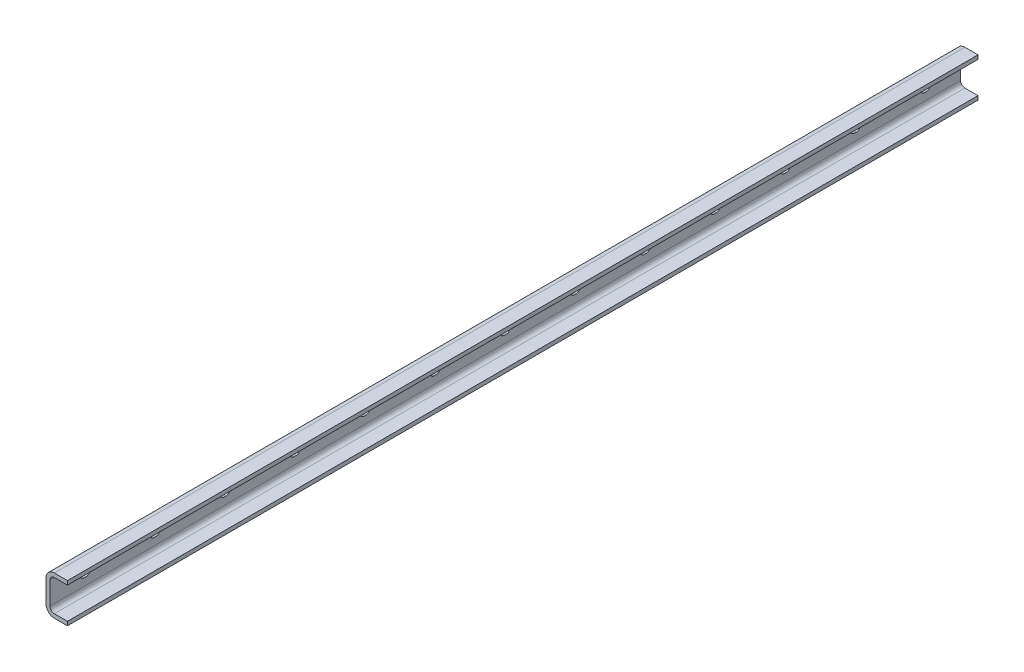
ISO-10303-21;
HEADER;
FILE_DESCRIPTION(('STEP AP214'),'2;1');
FILE_NAME('part.step','',(''),(''),'','','');
FILE_SCHEMA(('AUTOMOTIVE_DESIGN { 1 0 10303 214 1 1 1 1 }'));
ENDSEC;
DATA;
#1=APPLICATION_CONTEXT('core data for automotive mechanical design processes');
#2=APPLICATION_PROTOCOL_DEFINITION('international standard','automotive_design',2000,#1);
#3=PRODUCT_CONTEXT('',#1,'mechanical');
#4=PRODUCT('Part','Part','',(#3));
#5=PRODUCT_RELATED_PRODUCT_CATEGORY('part','',(#4));
#6=PRODUCT_DEFINITION_FORMATION('','',#4);
#7=PRODUCT_DEFINITION_CONTEXT('part definition',#1,'design');
#8=PRODUCT_DEFINITION('design','',#6,#7);
#9=PRODUCT_DEFINITION_SHAPE('','',#8);
#10=(LENGTH_UNIT() NAMED_UNIT(*) SI_UNIT(.MILLI.,.METRE.));
#11=(NAMED_UNIT(*) PLANE_ANGLE_UNIT() SI_UNIT($,.RADIAN.));
#12=(NAMED_UNIT(*) SI_UNIT($,.STERADIAN.) SOLID_ANGLE_UNIT());
#13=UNCERTAINTY_MEASURE_WITH_UNIT(LENGTH_MEASURE(1.E-05),#10,'distance_accuracy_value','');
#14=(GEOMETRIC_REPRESENTATION_CONTEXT(3) GLOBAL_UNCERTAINTY_ASSIGNED_CONTEXT((#13)) GLOBAL_UNIT_ASSIGNED_CONTEXT((#10,
#11,#12)) REPRESENTATION_CONTEXT('',''));
#15=CARTESIAN_POINT('',(0.,0.,0.));
#16=DIRECTION('',(0.,0.,1.));
#17=DIRECTION('',(1.,0.,0.));
#18=AXIS2_PLACEMENT_3D('',#15,#16,#17);
#19=CARTESIAN_POINT('',(9.5,17.9,-1040.));
#20=DIRECTION('',(0.,-1.,0.));
#21=DIRECTION('',(0.,0.,-1.));
#22=AXIS2_PLACEMENT_3D('',#19,#20,#21);
#23=PLANE('',#22);
#24=DIRECTION('',(1.,0.,0.));
#25=VECTOR('',#24,1.);
#26=CARTESIAN_POINT('',(9.5,17.9,0.));
#27=LINE('',#26,#25);
#28=CARTESIAN_POINT('',(9.5,17.9,0.));
#29=VERTEX_POINT('',#28);
#30=CARTESIAN_POINT('',(24.5,17.9,0.));
#31=VERTEX_POINT('',#30);
#32=EDGE_CURVE('E532',#29,#31,#27,.T.);
#33=ORIENTED_EDGE('',*,*,#32,.F.);
#34=DIRECTION('',(0.,0.,1.));
#35=VECTOR('',#34,1.);
#36=CARTESIAN_POINT('',(9.5,17.9,-1040.));
#37=LINE('',#36,#35);
#38=CARTESIAN_POINT('',(9.5,17.9,-1040.));
#39=VERTEX_POINT('',#38);
#40=EDGE_CURVE('E638',#39,#29,#37,.T.);
#41=ORIENTED_EDGE('',*,*,#40,.F.);
#42=DIRECTION('',(1.,0.,0.));
#43=VECTOR('',#42,1.);
#44=CARTESIAN_POINT('',(9.5,17.9,-1040.));
#45=LINE('',#44,#43);
#46=CARTESIAN_POINT('',(24.5,17.9,-1040.));
#47=VERTEX_POINT('',#46);
#48=EDGE_CURVE('E542',#39,#47,#45,.T.);
#49=ORIENTED_EDGE('',*,*,#48,.T.);
#50=DIRECTION('',(0.,0.,1.));
#51=VECTOR('',#50,1.);
#52=CARTESIAN_POINT('',(24.5,17.9,-1040.));
#53=LINE('',#52,#51);
#54=EDGE_CURVE('E591',#47,#31,#53,.T.);
#55=ORIENTED_EDGE('',*,*,#54,.T.);
#56=EDGE_LOOP('',(#33,#41,#49,#55));
#57=FACE_BOUND('',#56,.T.);
#58=ADVANCED_FACE('F39',(#57),#23,.T.);
#59=CARTESIAN_POINT('',(9.5,12.9,-1040.));
#60=DIRECTION('',(0.,0.,1.));
#61=DIRECTION('',(1.,0.,0.));
#62=AXIS2_PLACEMENT_3D('',#59,#60,#61);
#63=CYLINDRICAL_SURFACE('',#62,5.);
#64=CARTESIAN_POINT('',(9.5,12.9,0.));
#65=DIRECTION('',(0.,0.,-1.));
#66=DIRECTION('',(-1.,0.,0.));
#67=AXIS2_PLACEMENT_3D('',#64,#65,#66);
#68=CIRCLE('',#67,5.);
#69=CARTESIAN_POINT('',(4.5,12.9,0.));
#70=VERTEX_POINT('',#69);
#71=EDGE_CURVE('E547',#70,#29,#68,.T.);
#72=ORIENTED_EDGE('',*,*,#71,.F.);
#73=DIRECTION('',(0.,0.,1.));
#74=VECTOR('',#73,1.);
#75=CARTESIAN_POINT('',(4.5,12.9,-1040.));
#76=LINE('',#75,#74);
#77=CARTESIAN_POINT('',(4.5,12.9,-1040.));
#78=VERTEX_POINT('',#77);
#79=EDGE_CURVE('E642',#78,#70,#76,.T.);
#80=ORIENTED_EDGE('',*,*,#79,.F.);
#81=CARTESIAN_POINT('',(9.5,12.9,-1040.));
#82=DIRECTION('',(0.,0.,-1.));
#83=DIRECTION('',(-1.,0.,0.));
#84=AXIS2_PLACEMENT_3D('',#81,#82,#83);
#85=CIRCLE('',#84,5.);
#86=EDGE_CURVE('E587',#78,#39,#85,.T.);
#87=ORIENTED_EDGE('',*,*,#86,.T.);
#88=ORIENTED_EDGE('',*,*,#40,.T.);
#89=EDGE_LOOP('',(#72,#80,#87,#88));
#90=FACE_BOUND('',#89,.T.);
#91=ADVANCED_FACE('F1164',(#90),#63,.F.);
#92=CARTESIAN_POINT('',(4.5,-12.9,-1040.));
#93=DIRECTION('',(1.,0.,0.));
#94=DIRECTION('',(0.,0.,-1.));
#95=AXIS2_PLACEMENT_3D('',#92,#93,#94);
#96=PLANE('',#95);
#97=CARTESIAN_POINT('',(4.5,0.,-119.));
#98=DIRECTION('',(1.,0.,0.));
#99=DIRECTION('',(0.,0.,-1.));
#100=AXIS2_PLACEMENT_3D('',#97,#98,#99);
#101=CIRCLE('',#100,4.5);
#102=CARTESIAN_POINT('',(4.5,4.5,-119.));
#103=VERTEX_POINT('',#102);
#104=CARTESIAN_POINT('',(4.5,-4.5,-119.));
#105=VERTEX_POINT('',#104);
#106=EDGE_CURVE('E490',#103,#105,#101,.T.);
#107=ORIENTED_EDGE('',*,*,#106,.F.);
#108=DIRECTION('',(0.,0.,1.));
#109=VECTOR('',#108,1.);
#110=CARTESIAN_POINT('',(4.5,4.5,-119.));
#111=LINE('',#110,#109);
#112=CARTESIAN_POINT('',(4.5,4.5,-121.));
#113=VERTEX_POINT('',#112);
#114=EDGE_CURVE('E467',#113,#103,#111,.T.);
#115=ORIENTED_EDGE('',*,*,#114,.F.);
#116=CARTESIAN_POINT('',(4.5,0.,-121.));
#117=DIRECTION('',(1.,0.,0.));
#118=DIRECTION('',(0.,0.,1.));
#119=AXIS2_PLACEMENT_3D('',#116,#117,#118);
#120=CIRCLE('',#119,4.5);
#121=CARTESIAN_POINT('',(4.5,-4.5,-121.));
#122=VERTEX_POINT('',#121);
#123=EDGE_CURVE('E458',#122,#113,#120,.T.);
#124=ORIENTED_EDGE('',*,*,#123,.F.);
#125=DIRECTION('',(0.,0.,-1.));
#126=VECTOR('',#125,1.);
#127=CARTESIAN_POINT('',(4.5,-4.5,-119.));
#128=LINE('',#127,#126);
#129=EDGE_CURVE('E443',#105,#122,#128,.T.);
#130=ORIENTED_EDGE('',*,*,#129,.F.);
#131=EDGE_LOOP('',(#107,#115,#124,#130));
#132=FACE_BOUND('',#131,.T.);
#133=CARTESIAN_POINT('',(4.5,0.,-39.));
#134=DIRECTION('',(1.,0.,0.));
#135=DIRECTION('',(0.,0.,-1.));
#136=AXIS2_PLACEMENT_3D('',#133,#134,#135);
#137=CIRCLE('',#136,4.5);
#138=CARTESIAN_POINT('',(4.5,4.5,-39.));
#139=VERTEX_POINT('',#138);
#140=CARTESIAN_POINT('',(4.5,-4.5,-38.9999999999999));
#141=VERTEX_POINT('',#140);
#142=EDGE_CURVE('E497',#139,#141,#137,.T.);
#143=ORIENTED_EDGE('',*,*,#142,.F.);
#144=DIRECTION('',(0.,0.,1.));
#145=VECTOR('',#144,1.);
#146=CARTESIAN_POINT('',(4.5,4.5,-39.));
#147=LINE('',#146,#145);
#148=CARTESIAN_POINT('',(4.5,4.5,-41.));
#149=VERTEX_POINT('',#148);
#150=EDGE_CURVE('E503',#149,#139,#147,.T.);
#151=ORIENTED_EDGE('',*,*,#150,.F.);
#152=CARTESIAN_POINT('',(4.5,0.,-41.));
#153=DIRECTION('',(1.,0.,0.));
#154=DIRECTION('',(0.,0.,1.));
#155=AXIS2_PLACEMENT_3D('',#152,#153,#154);
#156=CIRCLE('',#155,4.5);
#157=CARTESIAN_POINT('',(4.5,-4.5,-41.));
#158=VERTEX_POINT('',#157);
#159=EDGE_CURVE('E522',#158,#149,#156,.T.);
#160=ORIENTED_EDGE('',*,*,#159,.F.);
#161=DIRECTION('',(0.,0.,-1.));
#162=VECTOR('',#161,1.);
#163=CARTESIAN_POINT('',(4.5,-4.5,-39.));
#164=LINE('',#163,#162);
#165=EDGE_CURVE('E518',#141,#158,#164,.T.);
#166=ORIENTED_EDGE('',*,*,#165,.F.);
#167=EDGE_LOOP('',(#143,#151,#160,#166));
#168=FACE_BOUND('',#167,.T.);
#169=DIRECTION('',(0.,1.,0.));
#170=VECTOR('',#169,1.);
#171=CARTESIAN_POINT('',(4.5,-12.9,0.));
#172=LINE('',#171,#170);
#173=CARTESIAN_POINT('',(4.5,-12.9,0.));
#174=VERTEX_POINT('',#173);
#175=EDGE_CURVE('E631',#174,#70,#172,.T.);
#176=ORIENTED_EDGE('',*,*,#175,.F.);
#177=DIRECTION('',(0.,0.,1.));
#178=VECTOR('',#177,1.);
#179=CARTESIAN_POINT('',(4.5,-12.9,-1040.));
#180=LINE('',#179,#178);
#181=CARTESIAN_POINT('',(4.5,-12.9,-1040.));
#182=VERTEX_POINT('',#181);
#183=EDGE_CURVE('E645',#182,#174,#180,.T.);
#184=ORIENTED_EDGE('',*,*,#183,.F.);
#185=DIRECTION('',(0.,1.,0.));
#186=VECTOR('',#185,1.);
#187=CARTESIAN_POINT('',(4.5,-12.9,-1040.));
#188=LINE('',#187,#186);
#189=EDGE_CURVE('E583',#182,#78,#188,.T.);
#190=ORIENTED_EDGE('',*,*,#189,.T.);
#191=ORIENTED_EDGE('',*,*,#79,.T.);
#192=EDGE_LOOP('',(#176,#184,#190,#191));
#193=FACE_BOUND('',#192,.T.);
#194=CARTESIAN_POINT('',(4.5,0.,-199.));
#195=DIRECTION('',(1.,0.,0.));
#196=DIRECTION('',(0.,0.,-1.));
#197=AXIS2_PLACEMENT_3D('',#194,#195,#196);
#198=CIRCLE('',#197,4.5);
#199=CARTESIAN_POINT('',(4.5,4.5,-199.));
#200=VERTEX_POINT('',#199);
#201=CARTESIAN_POINT('',(4.5,-4.5,-199.));
#202=VERTEX_POINT('',#201);
#203=EDGE_CURVE('E641',#200,#202,#198,.T.);
#204=ORIENTED_EDGE('',*,*,#203,.F.);
#205=DIRECTION('',(0.,0.,1.));
#206=VECTOR('',#205,1.);
#207=CARTESIAN_POINT('',(4.5,4.5,-199.));
#208=LINE('',#207,#206);
#209=CARTESIAN_POINT('',(4.5,4.5,-201.));
#210=VERTEX_POINT('',#209);
#211=EDGE_CURVE('E675',#210,#200,#208,.T.);
#212=ORIENTED_EDGE('',*,*,#211,.F.);
#213=CARTESIAN_POINT('',(4.5,0.,-201.));
#214=DIRECTION('',(1.,0.,0.));
#215=DIRECTION('',(0.,0.,1.));
#216=AXIS2_PLACEMENT_3D('',#213,#214,#215);
#217=CIRCLE('',#216,4.5);
#218=CARTESIAN_POINT('',(4.5,-4.5,-201.));
#219=VERTEX_POINT('',#218);
#220=EDGE_CURVE('E679',#219,#210,#217,.T.);
#221=ORIENTED_EDGE('',*,*,#220,.F.);
#222=DIRECTION('',(0.,0.,-1.));
#223=VECTOR('',#222,1.);
#224=CARTESIAN_POINT('',(4.5,-4.5,-199.));
#225=LINE('',#224,#223);
#226=EDGE_CURVE('E683',#202,#219,#225,.T.);
#227=ORIENTED_EDGE('',*,*,#226,.F.);
#228=EDGE_LOOP('',(#204,#212,#221,#227));
#229=FACE_BOUND('',#228,.T.);
#230=CARTESIAN_POINT('',(4.5,0.,-279.));
#231=DIRECTION('',(1.,0.,0.));
#232=DIRECTION('',(0.,0.,-1.));
#233=AXIS2_PLACEMENT_3D('',#230,#231,#232);
#234=CIRCLE('',#233,4.5);
#235=CARTESIAN_POINT('',(4.5,4.5,-279.));
#236=VERTEX_POINT('',#235);
#237=CARTESIAN_POINT('',(4.5,-4.5,-279.));
#238=VERTEX_POINT('',#237);
#239=EDGE_CURVE('E716',#236,#238,#234,.T.);
#240=ORIENTED_EDGE('',*,*,#239,.F.);
#241=DIRECTION('',(0.,0.,1.));
#242=VECTOR('',#241,1.);
#243=CARTESIAN_POINT('',(4.5,4.5,-279.));
#244=LINE('',#243,#242);
#245=CARTESIAN_POINT('',(4.5,4.5,-281.));
#246=VERTEX_POINT('',#245);
#247=EDGE_CURVE('E719',#246,#236,#244,.T.);
#248=ORIENTED_EDGE('',*,*,#247,.F.);
#249=CARTESIAN_POINT('',(4.5,0.,-281.));
#250=DIRECTION('',(1.,0.,0.));
#251=DIRECTION('',(0.,0.,1.));
#252=AXIS2_PLACEMENT_3D('',#249,#250,#251);
#253=CIRCLE('',#252,4.5);
#254=CARTESIAN_POINT('',(4.5,-4.5,-281.));
#255=VERTEX_POINT('',#254);
#256=EDGE_CURVE('E723',#255,#246,#253,.T.);
#257=ORIENTED_EDGE('',*,*,#256,.F.);
#258=DIRECTION('',(0.,0.,-1.));
#259=VECTOR('',#258,1.);
#260=CARTESIAN_POINT('',(4.5,-4.5,-279.));
#261=LINE('',#260,#259);
#262=EDGE_CURVE('E727',#238,#255,#261,.T.);
#263=ORIENTED_EDGE('',*,*,#262,.F.);
#264=EDGE_LOOP('',(#240,#248,#257,#263));
#265=FACE_BOUND('',#264,.T.);
#266=CARTESIAN_POINT('',(4.5,0.,-359.));
#267=DIRECTION('',(1.,0.,0.));
#268=DIRECTION('',(0.,0.,-1.));
#269=AXIS2_PLACEMENT_3D('',#266,#267,#268);
#270=CIRCLE('',#269,4.5);
#271=CARTESIAN_POINT('',(4.5,4.5,-359.));
#272=VERTEX_POINT('',#271);
#273=CARTESIAN_POINT('',(4.5,-4.5,-359.));
#274=VERTEX_POINT('',#273);
#275=EDGE_CURVE('E760',#272,#274,#270,.T.);
#276=ORIENTED_EDGE('',*,*,#275,.F.);
#277=DIRECTION('',(0.,0.,1.));
#278=VECTOR('',#277,1.);
#279=CARTESIAN_POINT('',(4.5,4.5,-359.));
#280=LINE('',#279,#278);
#281=CARTESIAN_POINT('',(4.5,4.5,-361.));
#282=VERTEX_POINT('',#281);
#283=EDGE_CURVE('E763',#282,#272,#280,.T.);
#284=ORIENTED_EDGE('',*,*,#283,.F.);
#285=CARTESIAN_POINT('',(4.5,0.,-361.));
#286=DIRECTION('',(1.,0.,0.));
#287=DIRECTION('',(0.,0.,1.));
#288=AXIS2_PLACEMENT_3D('',#285,#286,#287);
#289=CIRCLE('',#288,4.5);
#290=CARTESIAN_POINT('',(4.5,-4.5,-361.));
#291=VERTEX_POINT('',#290);
#292=EDGE_CURVE('E767',#291,#282,#289,.T.);
#293=ORIENTED_EDGE('',*,*,#292,.F.);
#294=DIRECTION('',(0.,0.,-1.));
#295=VECTOR('',#294,1.);
#296=CARTESIAN_POINT('',(4.5,-4.5,-359.));
#297=LINE('',#296,#295);
#298=EDGE_CURVE('E771',#274,#291,#297,.T.);
#299=ORIENTED_EDGE('',*,*,#298,.F.);
#300=EDGE_LOOP('',(#276,#284,#293,#299));
#301=FACE_BOUND('',#300,.T.);
#302=CARTESIAN_POINT('',(4.5,0.,-439.));
#303=DIRECTION('',(1.,0.,0.));
#304=DIRECTION('',(0.,0.,-1.));
#305=AXIS2_PLACEMENT_3D('',#302,#303,#304);
#306=CIRCLE('',#305,4.5);
#307=CARTESIAN_POINT('',(4.5,4.5,-439.));
#308=VERTEX_POINT('',#307);
#309=CARTESIAN_POINT('',(4.5,-4.5,-439.));
#310=VERTEX_POINT('',#309);
#311=EDGE_CURVE('E804',#308,#310,#306,.T.);
#312=ORIENTED_EDGE('',*,*,#311,.F.);
#313=DIRECTION('',(0.,0.,1.));
#314=VECTOR('',#313,1.);
#315=CARTESIAN_POINT('',(4.5,4.5,-439.));
#316=LINE('',#315,#314);
#317=CARTESIAN_POINT('',(4.5,4.5,-441.));
#318=VERTEX_POINT('',#317);
#319=EDGE_CURVE('E807',#318,#308,#316,.T.);
#320=ORIENTED_EDGE('',*,*,#319,.F.);
#321=CARTESIAN_POINT('',(4.5,0.,-441.));
#322=DIRECTION('',(1.,0.,0.));
#323=DIRECTION('',(0.,0.,1.));
#324=AXIS2_PLACEMENT_3D('',#321,#322,#323);
#325=CIRCLE('',#324,4.5);
#326=CARTESIAN_POINT('',(4.5,-4.5,-441.));
#327=VERTEX_POINT('',#326);
#328=EDGE_CURVE('E811',#327,#318,#325,.T.);
#329=ORIENTED_EDGE('',*,*,#328,.F.);
#330=DIRECTION('',(0.,0.,-1.));
#331=VECTOR('',#330,1.);
#332=CARTESIAN_POINT('',(4.5,-4.5,-439.));
#333=LINE('',#332,#331);
#334=EDGE_CURVE('E815',#310,#327,#333,.T.);
#335=ORIENTED_EDGE('',*,*,#334,.F.);
#336=EDGE_LOOP('',(#312,#320,#329,#335));
#337=FACE_BOUND('',#336,.T.);
#338=CARTESIAN_POINT('',(4.5,0.,-519.));
#339=DIRECTION('',(1.,0.,0.));
#340=DIRECTION('',(0.,0.,-1.));
#341=AXIS2_PLACEMENT_3D('',#338,#339,#340);
#342=CIRCLE('',#341,4.5);
#343=CARTESIAN_POINT('',(4.5,4.5,-519.));
#344=VERTEX_POINT('',#343);
#345=CARTESIAN_POINT('',(4.5,-4.5,-519.));
#346=VERTEX_POINT('',#345);
#347=EDGE_CURVE('E848',#344,#346,#342,.T.);
#348=ORIENTED_EDGE('',*,*,#347,.F.);
#349=DIRECTION('',(0.,0.,1.));
#350=VECTOR('',#349,1.);
#351=CARTESIAN_POINT('',(4.5,4.5,-519.));
#352=LINE('',#351,#350);
#353=CARTESIAN_POINT('',(4.5,4.5,-521.));
#354=VERTEX_POINT('',#353);
#355=EDGE_CURVE('E851',#354,#344,#352,.T.);
#356=ORIENTED_EDGE('',*,*,#355,.F.);
#357=CARTESIAN_POINT('',(4.5,0.,-521.));
#358=DIRECTION('',(1.,0.,0.));
#359=DIRECTION('',(0.,0.,1.));
#360=AXIS2_PLACEMENT_3D('',#357,#358,#359);
#361=CIRCLE('',#360,4.5);
#362=CARTESIAN_POINT('',(4.5,-4.5,-521.));
#363=VERTEX_POINT('',#362);
#364=EDGE_CURVE('E855',#363,#354,#361,.T.);
#365=ORIENTED_EDGE('',*,*,#364,.F.);
#366=DIRECTION('',(0.,0.,-1.));
#367=VECTOR('',#366,1.);
#368=CARTESIAN_POINT('',(4.5,-4.5,-519.));
#369=LINE('',#368,#367);
#370=EDGE_CURVE('E859',#346,#363,#369,.T.);
#371=ORIENTED_EDGE('',*,*,#370,.F.);
#372=EDGE_LOOP('',(#348,#356,#365,#371));
#373=FACE_BOUND('',#372,.T.);
#374=CARTESIAN_POINT('',(4.5,0.,-599.));
#375=DIRECTION('',(1.,0.,0.));
#376=DIRECTION('',(0.,0.,-1.));
#377=AXIS2_PLACEMENT_3D('',#374,#375,#376);
#378=CIRCLE('',#377,4.5);
#379=CARTESIAN_POINT('',(4.5,4.5,-599.));
#380=VERTEX_POINT('',#379);
#381=CARTESIAN_POINT('',(4.5,-4.5,-599.));
#382=VERTEX_POINT('',#381);
#383=EDGE_CURVE('E892',#380,#382,#378,.T.);
#384=ORIENTED_EDGE('',*,*,#383,.F.);
#385=DIRECTION('',(0.,0.,1.));
#386=VECTOR('',#385,1.);
#387=CARTESIAN_POINT('',(4.5,4.5,-599.));
#388=LINE('',#387,#386);
#389=CARTESIAN_POINT('',(4.5,4.5,-601.));
#390=VERTEX_POINT('',#389);
#391=EDGE_CURVE('E895',#390,#380,#388,.T.);
#392=ORIENTED_EDGE('',*,*,#391,.F.);
#393=CARTESIAN_POINT('',(4.5,0.,-601.));
#394=DIRECTION('',(1.,0.,0.));
#395=DIRECTION('',(0.,0.,1.));
#396=AXIS2_PLACEMENT_3D('',#393,#394,#395);
#397=CIRCLE('',#396,4.5);
#398=CARTESIAN_POINT('',(4.5,-4.5,-601.));
#399=VERTEX_POINT('',#398);
#400=EDGE_CURVE('E899',#399,#390,#397,.T.);
#401=ORIENTED_EDGE('',*,*,#400,.F.);
#402=DIRECTION('',(0.,0.,-1.));
#403=VECTOR('',#402,1.);
#404=CARTESIAN_POINT('',(4.5,-4.5,-599.));
#405=LINE('',#404,#403);
#406=EDGE_CURVE('E903',#382,#399,#405,.T.);
#407=ORIENTED_EDGE('',*,*,#406,.F.);
#408=EDGE_LOOP('',(#384,#392,#401,#407));
#409=FACE_BOUND('',#408,.T.);
#410=CARTESIAN_POINT('',(4.5,0.,-679.));
#411=DIRECTION('',(1.,0.,0.));
#412=DIRECTION('',(0.,0.,-1.));
#413=AXIS2_PLACEMENT_3D('',#410,#411,#412);
#414=CIRCLE('',#413,4.5);
#415=CARTESIAN_POINT('',(4.5,4.5,-679.));
#416=VERTEX_POINT('',#415);
#417=CARTESIAN_POINT('',(4.5,-4.5,-679.));
#418=VERTEX_POINT('',#417);
#419=EDGE_CURVE('E936',#416,#418,#414,.T.);
#420=ORIENTED_EDGE('',*,*,#419,.F.);
#421=DIRECTION('',(0.,0.,1.));
#422=VECTOR('',#421,1.);
#423=CARTESIAN_POINT('',(4.5,4.5,-679.));
#424=LINE('',#423,#422);
#425=CARTESIAN_POINT('',(4.5,4.5,-681.));
#426=VERTEX_POINT('',#425);
#427=EDGE_CURVE('E939',#426,#416,#424,.T.);
#428=ORIENTED_EDGE('',*,*,#427,.F.);
#429=CARTESIAN_POINT('',(4.5,0.,-681.));
#430=DIRECTION('',(1.,0.,0.));
#431=DIRECTION('',(0.,0.,1.));
#432=AXIS2_PLACEMENT_3D('',#429,#430,#431);
#433=CIRCLE('',#432,4.5);
#434=CARTESIAN_POINT('',(4.5,-4.5,-681.));
#435=VERTEX_POINT('',#434);
#436=EDGE_CURVE('E943',#435,#426,#433,.T.);
#437=ORIENTED_EDGE('',*,*,#436,.F.);
#438=DIRECTION('',(0.,0.,-1.));
#439=VECTOR('',#438,1.);
#440=CARTESIAN_POINT('',(4.5,-4.5,-679.));
#441=LINE('',#440,#439);
#442=EDGE_CURVE('E947',#418,#435,#441,.T.);
#443=ORIENTED_EDGE('',*,*,#442,.F.);
#444=EDGE_LOOP('',(#420,#428,#437,#443));
#445=FACE_BOUND('',#444,.T.);
#446=CARTESIAN_POINT('',(4.5,0.,-759.));
#447=DIRECTION('',(1.,0.,0.));
#448=DIRECTION('',(0.,0.,-1.));
#449=AXIS2_PLACEMENT_3D('',#446,#447,#448);
#450=CIRCLE('',#449,4.5);
#451=CARTESIAN_POINT('',(4.5,4.5,-759.));
#452=VERTEX_POINT('',#451);
#453=CARTESIAN_POINT('',(4.5,-4.5,-759.));
#454=VERTEX_POINT('',#453);
#455=EDGE_CURVE('E980',#452,#454,#450,.T.);
#456=ORIENTED_EDGE('',*,*,#455,.F.);
#457=DIRECTION('',(0.,0.,1.));
#458=VECTOR('',#457,1.);
#459=CARTESIAN_POINT('',(4.5,4.5,-759.));
#460=LINE('',#459,#458);
#461=CARTESIAN_POINT('',(4.5,4.5,-761.));
#462=VERTEX_POINT('',#461);
#463=EDGE_CURVE('E983',#462,#452,#460,.T.);
#464=ORIENTED_EDGE('',*,*,#463,.F.);
#465=CARTESIAN_POINT('',(4.5,0.,-761.));
#466=DIRECTION('',(1.,0.,0.));
#467=DIRECTION('',(0.,0.,1.));
#468=AXIS2_PLACEMENT_3D('',#465,#466,#467);
#469=CIRCLE('',#468,4.5);
#470=CARTESIAN_POINT('',(4.5,-4.5,-761.));
#471=VERTEX_POINT('',#470);
#472=EDGE_CURVE('E987',#471,#462,#469,.T.);
#473=ORIENTED_EDGE('',*,*,#472,.F.);
#474=DIRECTION('',(0.,0.,-1.));
#475=VECTOR('',#474,1.);
#476=CARTESIAN_POINT('',(4.5,-4.5,-759.));
#477=LINE('',#476,#475);
#478=EDGE_CURVE('E991',#454,#471,#477,.T.);
#479=ORIENTED_EDGE('',*,*,#478,.F.);
#480=EDGE_LOOP('',(#456,#464,#473,#479));
#481=FACE_BOUND('',#480,.T.);
#482=CARTESIAN_POINT('',(4.5,0.,-839.));
#483=DIRECTION('',(1.,0.,0.));
#484=DIRECTION('',(0.,0.,-1.));
#485=AXIS2_PLACEMENT_3D('',#482,#483,#484);
#486=CIRCLE('',#485,4.5);
#487=CARTESIAN_POINT('',(4.5,4.5,-839.));
#488=VERTEX_POINT('',#487);
#489=CARTESIAN_POINT('',(4.5,-4.5,-839.));
#490=VERTEX_POINT('',#489);
#491=EDGE_CURVE('E1024',#488,#490,#486,.T.);
#492=ORIENTED_EDGE('',*,*,#491,.F.);
#493=DIRECTION('',(0.,0.,1.));
#494=VECTOR('',#493,1.);
#495=CARTESIAN_POINT('',(4.5,4.5,-839.));
#496=LINE('',#495,#494);
#497=CARTESIAN_POINT('',(4.5,4.5,-841.));
#498=VERTEX_POINT('',#497);
#499=EDGE_CURVE('E1027',#498,#488,#496,.T.);
#500=ORIENTED_EDGE('',*,*,#499,.F.);
#501=CARTESIAN_POINT('',(4.5,0.,-841.));
#502=DIRECTION('',(1.,0.,0.));
#503=DIRECTION('',(0.,0.,1.));
#504=AXIS2_PLACEMENT_3D('',#501,#502,#503);
#505=CIRCLE('',#504,4.5);
#506=CARTESIAN_POINT('',(4.5,-4.5,-841.));
#507=VERTEX_POINT('',#506);
#508=EDGE_CURVE('E1031',#507,#498,#505,.T.);
#509=ORIENTED_EDGE('',*,*,#508,.F.);
#510=DIRECTION('',(0.,0.,-1.));
#511=VECTOR('',#510,1.);
#512=CARTESIAN_POINT('',(4.5,-4.5,-839.));
#513=LINE('',#512,#511);
#514=EDGE_CURVE('E1035',#490,#507,#513,.T.);
#515=ORIENTED_EDGE('',*,*,#514,.F.);
#516=EDGE_LOOP('',(#492,#500,#509,#515));
#517=FACE_BOUND('',#516,.T.);
#518=CARTESIAN_POINT('',(4.5,0.,-919.));
#519=DIRECTION('',(1.,0.,0.));
#520=DIRECTION('',(0.,0.,-1.));
#521=AXIS2_PLACEMENT_3D('',#518,#519,#520);
#522=CIRCLE('',#521,4.5);
#523=CARTESIAN_POINT('',(4.5,4.5,-919.));
#524=VERTEX_POINT('',#523);
#525=CARTESIAN_POINT('',(4.5,-4.5,-919.));
#526=VERTEX_POINT('',#525);
#527=EDGE_CURVE('E1068',#524,#526,#522,.T.);
#528=ORIENTED_EDGE('',*,*,#527,.F.);
#529=DIRECTION('',(0.,0.,1.));
#530=VECTOR('',#529,1.);
#531=CARTESIAN_POINT('',(4.5,4.5,-919.));
#532=LINE('',#531,#530);
#533=CARTESIAN_POINT('',(4.5,4.5,-921.));
#534=VERTEX_POINT('',#533);
#535=EDGE_CURVE('E1071',#534,#524,#532,.T.);
#536=ORIENTED_EDGE('',*,*,#535,.F.);
#537=CARTESIAN_POINT('',(4.5,0.,-921.));
#538=DIRECTION('',(1.,0.,0.));
#539=DIRECTION('',(0.,0.,1.));
#540=AXIS2_PLACEMENT_3D('',#537,#538,#539);
#541=CIRCLE('',#540,4.5);
#542=CARTESIAN_POINT('',(4.5,-4.5,-921.));
#543=VERTEX_POINT('',#542);
#544=EDGE_CURVE('E1075',#543,#534,#541,.T.);
#545=ORIENTED_EDGE('',*,*,#544,.F.);
#546=DIRECTION('',(0.,0.,-1.));
#547=VECTOR('',#546,1.);
#548=CARTESIAN_POINT('',(4.5,-4.5,-919.));
#549=LINE('',#548,#547);
#550=EDGE_CURVE('E1079',#526,#543,#549,.T.);
#551=ORIENTED_EDGE('',*,*,#550,.F.);
#552=EDGE_LOOP('',(#528,#536,#545,#551));
#553=FACE_BOUND('',#552,.T.);
#554=CARTESIAN_POINT('',(4.5,0.,-999.));
#555=DIRECTION('',(1.,0.,0.));
#556=DIRECTION('',(0.,0.,-1.));
#557=AXIS2_PLACEMENT_3D('',#554,#555,#556);
#558=CIRCLE('',#557,4.5);
#559=CARTESIAN_POINT('',(4.5,4.5,-999.));
#560=VERTEX_POINT('',#559);
#561=CARTESIAN_POINT('',(4.5,-4.5,-999.));
#562=VERTEX_POINT('',#561);
#563=EDGE_CURVE('E1112',#560,#562,#558,.T.);
#564=ORIENTED_EDGE('',*,*,#563,.F.);
#565=DIRECTION('',(0.,0.,1.));
#566=VECTOR('',#565,1.);
#567=CARTESIAN_POINT('',(4.5,4.5,-999.));
#568=LINE('',#567,#566);
#569=CARTESIAN_POINT('',(4.5,4.5,-1001.));
#570=VERTEX_POINT('',#569);
#571=EDGE_CURVE('E1115',#570,#560,#568,.T.);
#572=ORIENTED_EDGE('',*,*,#571,.F.);
#573=CARTESIAN_POINT('',(4.5,0.,-1001.));
#574=DIRECTION('',(1.,0.,0.));
#575=DIRECTION('',(0.,0.,1.));
#576=AXIS2_PLACEMENT_3D('',#573,#574,#575);
#577=CIRCLE('',#576,4.5);
#578=CARTESIAN_POINT('',(4.5,-4.5,-1001.));
#579=VERTEX_POINT('',#578);
#580=EDGE_CURVE('E1119',#579,#570,#577,.T.);
#581=ORIENTED_EDGE('',*,*,#580,.F.);
#582=DIRECTION('',(0.,0.,-1.));
#583=VECTOR('',#582,1.);
#584=CARTESIAN_POINT('',(4.5,-4.5,-999.));
#585=LINE('',#584,#583);
#586=EDGE_CURVE('E1123',#562,#579,#585,.T.);
#587=ORIENTED_EDGE('',*,*,#586,.F.);
#588=EDGE_LOOP('',(#564,#572,#581,#587));
#589=FACE_BOUND('',#588,.T.);
#590=ADVANCED_FACE('F465',(#132,#168,#193,#229,#265,#301,#337,#373,#409,#445,#481,#517,#553,
#589),#96,.T.);
#591=CARTESIAN_POINT('',(9.49999999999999,-12.9,-1040.));
#592=DIRECTION('',(0.,0.,1.));
#593=DIRECTION('',(1.,0.,0.));
#594=AXIS2_PLACEMENT_3D('',#591,#592,#593);
#595=CYLINDRICAL_SURFACE('',#594,4.99999999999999);
#596=CARTESIAN_POINT('',(9.49999999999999,-12.9,0.));
#597=DIRECTION('',(0.,0.,-1.));
#598=DIRECTION('',(-1.,0.,0.));
#599=AXIS2_PLACEMENT_3D('',#596,#597,#598);
#600=CIRCLE('',#599,4.99999999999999);
#601=CARTESIAN_POINT('',(9.49999999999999,-17.9,0.));
#602=VERTEX_POINT('',#601);
#603=EDGE_CURVE('E627',#602,#174,#600,.T.);
#604=ORIENTED_EDGE('',*,*,#603,.F.);
#605=DIRECTION('',(0.,0.,1.));
#606=VECTOR('',#605,1.);
#607=CARTESIAN_POINT('',(9.49999999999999,-17.9,-1040.));
#608=LINE('',#607,#606);
#609=CARTESIAN_POINT('',(9.49999999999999,-17.9,-1040.));
#610=VERTEX_POINT('',#609);
#611=EDGE_CURVE('E647',#610,#602,#608,.T.);
#612=ORIENTED_EDGE('',*,*,#611,.F.);
#613=CARTESIAN_POINT('',(9.49999999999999,-12.9,-1040.));
#614=DIRECTION('',(0.,0.,-1.));
#615=DIRECTION('',(-1.,0.,0.));
#616=AXIS2_PLACEMENT_3D('',#613,#614,#615);
#617=CIRCLE('',#616,4.99999999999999);
#618=EDGE_CURVE('E579',#610,#182,#617,.T.);
#619=ORIENTED_EDGE('',*,*,#618,.T.);
#620=ORIENTED_EDGE('',*,*,#183,.T.);
#621=EDGE_LOOP('',(#604,#612,#619,#620));
#622=FACE_BOUND('',#621,.T.);
#623=ADVANCED_FACE('F1349',(#622),#595,.F.);
#624=CARTESIAN_POINT('',(24.5,-17.9,-1040.));
#625=DIRECTION('',(0.,1.,0.));
#626=DIRECTION('',(0.,0.,1.));
#627=AXIS2_PLACEMENT_3D('',#624,#625,#626);
#628=PLANE('',#627);
#629=DIRECTION('',(-1.,0.,0.));
#630=VECTOR('',#629,1.);
#631=CARTESIAN_POINT('',(24.5,-17.9,0.));
#632=LINE('',#631,#630);
#633=CARTESIAN_POINT('',(24.5,-17.9,0.));
#634=VERTEX_POINT('',#633);
#635=EDGE_CURVE('E623',#634,#602,#632,.T.);
#636=ORIENTED_EDGE('',*,*,#635,.F.);
#637=DIRECTION('',(0.,0.,1.));
#638=VECTOR('',#637,1.);
#639=CARTESIAN_POINT('',(24.5,-17.9,-1040.));
#640=LINE('',#639,#638);
#641=CARTESIAN_POINT('',(24.5,-17.9,-1040.));
#642=VERTEX_POINT('',#641);
#643=EDGE_CURVE('E650',#642,#634,#640,.T.);
#644=ORIENTED_EDGE('',*,*,#643,.F.);
#645=DIRECTION('',(-1.,0.,0.));
#646=VECTOR('',#645,1.);
#647=CARTESIAN_POINT('',(24.5,-17.9,-1040.));
#648=LINE('',#647,#646);
#649=EDGE_CURVE('E575',#642,#610,#648,.T.);
#650=ORIENTED_EDGE('',*,*,#649,.T.);
#651=ORIENTED_EDGE('',*,*,#611,.T.);
#652=EDGE_LOOP('',(#636,#644,#650,#651));
#653=FACE_BOUND('',#652,.T.);
#654=ADVANCED_FACE('F1354',(#653),#628,.T.);
#655=CARTESIAN_POINT('',(24.5,-22.4,-1040.));
#656=DIRECTION('',(1.,0.,0.));
#657=DIRECTION('',(0.,0.,-1.));
#658=AXIS2_PLACEMENT_3D('',#655,#656,#657);
#659=PLANE('',#658);
#660=DIRECTION('',(0.,1.,0.));
#661=VECTOR('',#660,1.);
#662=CARTESIAN_POINT('',(24.5,-22.4,0.));
#663=LINE('',#662,#661);
#664=CARTESIAN_POINT('',(24.5,-22.4,0.));
#665=VERTEX_POINT('',#664);
#666=EDGE_CURVE('E619',#665,#634,#663,.T.);
#667=ORIENTED_EDGE('',*,*,#666,.F.);
#668=DIRECTION('',(0.,0.,1.));
#669=VECTOR('',#668,1.);
#670=CARTESIAN_POINT('',(24.5,-22.4,-1040.));
#671=LINE('',#670,#669);
#672=CARTESIAN_POINT('',(24.5,-22.4,-1040.));
#673=VERTEX_POINT('',#672);
#674=EDGE_CURVE('E653',#673,#665,#671,.T.);
#675=ORIENTED_EDGE('',*,*,#674,.F.);
#676=DIRECTION('',(0.,1.,0.));
#677=VECTOR('',#676,1.);
#678=CARTESIAN_POINT('',(24.5,-22.4,-1040.));
#679=LINE('',#678,#677);
#680=EDGE_CURVE('E571',#673,#642,#679,.T.);
#681=ORIENTED_EDGE('',*,*,#680,.T.);
#682=ORIENTED_EDGE('',*,*,#643,.T.);
#683=EDGE_LOOP('',(#667,#675,#681,#682));
#684=FACE_BOUND('',#683,.T.);
#685=ADVANCED_FACE('F1361',(#684),#659,.T.);
#686=CARTESIAN_POINT('',(9.5,-22.4,-1040.));
#687=DIRECTION('',(0.,-1.,0.));
#688=DIRECTION('',(1.,0.,0.));
#689=AXIS2_PLACEMENT_3D('',#686,#687,#688);
#690=PLANE('',#689);
#691=DIRECTION('',(1.,0.,0.));
#692=VECTOR('',#691,1.);
#693=CARTESIAN_POINT('',(9.5,-22.4,0.));
#694=LINE('',#693,#692);
#695=CARTESIAN_POINT('',(9.5,-22.4,0.));
#696=VERTEX_POINT('',#695);
#697=EDGE_CURVE('E615',#696,#665,#694,.T.);
#698=ORIENTED_EDGE('',*,*,#697,.F.);
#699=DIRECTION('',(0.,0.,1.));
#700=VECTOR('',#699,1.);
#701=CARTESIAN_POINT('',(9.5,-22.4,-1040.));
#702=LINE('',#701,#700);
#703=CARTESIAN_POINT('',(9.5,-22.4,-1040.));
#704=VERTEX_POINT('',#703);
#705=EDGE_CURVE('E656',#704,#696,#702,.T.);
#706=ORIENTED_EDGE('',*,*,#705,.F.);
#707=DIRECTION('',(1.,0.,0.));
#708=VECTOR('',#707,1.);
#709=CARTESIAN_POINT('',(9.5,-22.4,-1040.));
#710=LINE('',#709,#708);
#711=EDGE_CURVE('E567',#704,#673,#710,.T.);
#712=ORIENTED_EDGE('',*,*,#711,.T.);
#713=ORIENTED_EDGE('',*,*,#674,.T.);
#714=EDGE_LOOP('',(#698,#706,#712,#713));
#715=FACE_BOUND('',#714,.T.);
#716=ADVANCED_FACE('F1365',(#715),#690,.T.);
#717=CARTESIAN_POINT('',(9.5,-12.9,-1040.));
#718=DIRECTION('',(0.,0.,1.));
#719=DIRECTION('',(1.,0.,0.));
#720=AXIS2_PLACEMENT_3D('',#717,#718,#719);
#721=CYLINDRICAL_SURFACE('',#720,9.5);
#722=CARTESIAN_POINT('',(9.5,-12.9,0.));
#723=DIRECTION('',(0.,0.,1.));
#724=DIRECTION('',(1.,0.,0.));
#725=AXIS2_PLACEMENT_3D('',#722,#723,#724);
#726=CIRCLE('',#725,9.5);
#727=CARTESIAN_POINT('',(0.,-12.9,0.));
#728=VERTEX_POINT('',#727);
#729=EDGE_CURVE('E611',#728,#696,#726,.T.);
#730=ORIENTED_EDGE('',*,*,#729,.F.);
#731=DIRECTION('',(0.,0.,1.));
#732=VECTOR('',#731,1.);
#733=CARTESIAN_POINT('',(0.,-12.9,-1040.));
#734=LINE('',#733,#732);
#735=CARTESIAN_POINT('',(0.,-12.9,-1040.));
#736=VERTEX_POINT('',#735);
#737=EDGE_CURVE('E659',#736,#728,#734,.T.);
#738=ORIENTED_EDGE('',*,*,#737,.F.);
#739=CARTESIAN_POINT('',(9.5,-12.9,-1040.));
#740=DIRECTION('',(0.,0.,1.));
#741=DIRECTION('',(1.,0.,0.));
#742=AXIS2_PLACEMENT_3D('',#739,#740,#741);
#743=CIRCLE('',#742,9.5);
#744=EDGE_CURVE('E563',#736,#704,#743,.T.);
#745=ORIENTED_EDGE('',*,*,#744,.T.);
#746=ORIENTED_EDGE('',*,*,#705,.T.);
#747=EDGE_LOOP('',(#730,#738,#745,#746));
#748=FACE_BOUND('',#747,.T.);
#749=ADVANCED_FACE('F1369',(#748),#721,.T.);
#750=CARTESIAN_POINT('',(0.,12.9,-1040.));
#751=DIRECTION('',(-1.,0.,0.));
#752=DIRECTION('',(0.,0.,1.));
#753=AXIS2_PLACEMENT_3D('',#750,#751,#752);
#754=PLANE('',#753);
#755=CARTESIAN_POINT('',(0.,0.,-119.));
#756=DIRECTION('',(1.,0.,0.));
#757=DIRECTION('',(0.,0.,-1.));
#758=AXIS2_PLACEMENT_3D('',#755,#756,#757);
#759=CIRCLE('',#758,4.5);
#760=CARTESIAN_POINT('',(0.,4.5,-119.));
#761=VERTEX_POINT('',#760);
#762=CARTESIAN_POINT('',(0.,-4.5,-119.));
#763=VERTEX_POINT('',#762);
#764=EDGE_CURVE('E493',#761,#763,#759,.T.);
#765=ORIENTED_EDGE('',*,*,#764,.T.);
#766=DIRECTION('',(0.,0.,-1.));
#767=VECTOR('',#766,1.);
#768=CARTESIAN_POINT('',(0.,-4.5,-119.));
#769=LINE('',#768,#767);
#770=CARTESIAN_POINT('',(0.,-4.5,-121.));
#771=VERTEX_POINT('',#770);
#772=EDGE_CURVE('E454',#763,#771,#769,.T.);
#773=ORIENTED_EDGE('',*,*,#772,.T.);
#774=CARTESIAN_POINT('',(0.,0.,-121.));
#775=DIRECTION('',(1.,0.,0.));
#776=DIRECTION('',(0.,0.,1.));
#777=AXIS2_PLACEMENT_3D('',#774,#775,#776);
#778=CIRCLE('',#777,4.5);
#779=CARTESIAN_POINT('',(0.,4.5,-121.));
#780=VERTEX_POINT('',#779);
#781=EDGE_CURVE('E461',#771,#780,#778,.T.);
#782=ORIENTED_EDGE('',*,*,#781,.T.);
#783=DIRECTION('',(0.,0.,1.));
#784=VECTOR('',#783,1.);
#785=CARTESIAN_POINT('',(0.,4.5,-119.));
#786=LINE('',#785,#784);
#787=EDGE_CURVE('E486',#780,#761,#786,.T.);
#788=ORIENTED_EDGE('',*,*,#787,.T.);
#789=EDGE_LOOP('',(#765,#773,#782,#788));
#790=FACE_BOUND('',#789,.T.);
#791=CARTESIAN_POINT('',(0.,0.,-39.));
#792=DIRECTION('',(1.,0.,0.));
#793=DIRECTION('',(0.,0.,-1.));
#794=AXIS2_PLACEMENT_3D('',#791,#792,#793);
#795=CIRCLE('',#794,4.5);
#796=CARTESIAN_POINT('',(0.,4.5,-39.));
#797=VERTEX_POINT('',#796);
#798=CARTESIAN_POINT('',(0.,-4.5,-39.));
#799=VERTEX_POINT('',#798);
#800=EDGE_CURVE('E498',#797,#799,#795,.T.);
#801=ORIENTED_EDGE('',*,*,#800,.T.);
#802=DIRECTION('',(0.,0.,-1.));
#803=VECTOR('',#802,1.);
#804=CARTESIAN_POINT('',(0.,-4.5,-39.));
#805=LINE('',#804,#803);
#806=CARTESIAN_POINT('',(0.,-4.5,-40.9999999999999));
#807=VERTEX_POINT('',#806);
#808=EDGE_CURVE('E502',#799,#807,#805,.T.);
#809=ORIENTED_EDGE('',*,*,#808,.T.);
#810=CARTESIAN_POINT('',(0.,0.,-41.));
#811=DIRECTION('',(1.,0.,0.));
#812=DIRECTION('',(0.,0.,1.));
#813=AXIS2_PLACEMENT_3D('',#810,#811,#812);
#814=CIRCLE('',#813,4.5);
#815=CARTESIAN_POINT('',(0.,4.5,-41.));
#816=VERTEX_POINT('',#815);
#817=EDGE_CURVE('E507',#807,#816,#814,.T.);
#818=ORIENTED_EDGE('',*,*,#817,.T.);
#819=DIRECTION('',(0.,0.,1.));
#820=VECTOR('',#819,1.);
#821=CARTESIAN_POINT('',(0.,4.5,-39.));
#822=LINE('',#821,#820);
#823=EDGE_CURVE('E511',#816,#797,#822,.T.);
#824=ORIENTED_EDGE('',*,*,#823,.T.);
#825=EDGE_LOOP('',(#801,#809,#818,#824));
#826=FACE_BOUND('',#825,.T.);
#827=DIRECTION('',(0.,-1.,0.));
#828=VECTOR('',#827,1.);
#829=CARTESIAN_POINT('',(0.,12.9,0.));
#830=LINE('',#829,#828);
#831=CARTESIAN_POINT('',(0.,12.9,0.));
#832=VERTEX_POINT('',#831);
#833=EDGE_CURVE('E607',#832,#728,#830,.T.);
#834=ORIENTED_EDGE('',*,*,#833,.F.);
#835=DIRECTION('',(0.,0.,1.));
#836=VECTOR('',#835,1.);
#837=CARTESIAN_POINT('',(0.,12.9,-1040.));
#838=LINE('',#837,#836);
#839=CARTESIAN_POINT('',(0.,12.9,-1040.));
#840=VERTEX_POINT('',#839);
#841=EDGE_CURVE('E662',#840,#832,#838,.T.);
#842=ORIENTED_EDGE('',*,*,#841,.F.);
#843=DIRECTION('',(0.,-1.,0.));
#844=VECTOR('',#843,1.);
#845=CARTESIAN_POINT('',(0.,12.9,-1040.));
#846=LINE('',#845,#844);
#847=EDGE_CURVE('E559',#840,#736,#846,.T.);
#848=ORIENTED_EDGE('',*,*,#847,.T.);
#849=ORIENTED_EDGE('',*,*,#737,.T.);
#850=EDGE_LOOP('',(#834,#842,#848,#849));
#851=FACE_BOUND('',#850,.T.);
#852=CARTESIAN_POINT('',(0.,0.,-199.));
#853=DIRECTION('',(1.,0.,0.));
#854=DIRECTION('',(0.,0.,-1.));
#855=AXIS2_PLACEMENT_3D('',#852,#853,#854);
#856=CIRCLE('',#855,4.5);
#857=CARTESIAN_POINT('',(0.,4.5,-199.));
#858=VERTEX_POINT('',#857);
#859=CARTESIAN_POINT('',(0.,-4.5,-199.));
#860=VERTEX_POINT('',#859);
#861=EDGE_CURVE('E687',#858,#860,#856,.T.);
#862=ORIENTED_EDGE('',*,*,#861,.T.);
#863=DIRECTION('',(0.,0.,-1.));
#864=VECTOR('',#863,1.);
#865=CARTESIAN_POINT('',(0.,-4.5,-199.));
#866=LINE('',#865,#864);
#867=CARTESIAN_POINT('',(0.,-4.5,-201.));
#868=VERTEX_POINT('',#867);
#869=EDGE_CURVE('E690',#860,#868,#866,.T.);
#870=ORIENTED_EDGE('',*,*,#869,.T.);
#871=CARTESIAN_POINT('',(0.,0.,-201.));
#872=DIRECTION('',(1.,0.,0.));
#873=DIRECTION('',(0.,0.,1.));
#874=AXIS2_PLACEMENT_3D('',#871,#872,#873);
#875=CIRCLE('',#874,4.5);
#876=CARTESIAN_POINT('',(0.,4.5,-201.));
#877=VERTEX_POINT('',#876);
#878=EDGE_CURVE('E693',#868,#877,#875,.T.);
#879=ORIENTED_EDGE('',*,*,#878,.T.);
#880=DIRECTION('',(0.,0.,1.));
#881=VECTOR('',#880,1.);
#882=CARTESIAN_POINT('',(0.,4.5,-199.));
#883=LINE('',#882,#881);
#884=EDGE_CURVE('E696',#877,#858,#883,.T.);
#885=ORIENTED_EDGE('',*,*,#884,.T.);
#886=EDGE_LOOP('',(#862,#870,#879,#885));
#887=FACE_BOUND('',#886,.T.);
#888=CARTESIAN_POINT('',(0.,0.,-279.));
#889=DIRECTION('',(1.,0.,0.));
#890=DIRECTION('',(0.,0.,-1.));
#891=AXIS2_PLACEMENT_3D('',#888,#889,#890);
#892=CIRCLE('',#891,4.5);
#893=CARTESIAN_POINT('',(0.,4.5,-279.));
#894=VERTEX_POINT('',#893);
#895=CARTESIAN_POINT('',(0.,-4.5,-279.));
#896=VERTEX_POINT('',#895);
#897=EDGE_CURVE('E731',#894,#896,#892,.T.);
#898=ORIENTED_EDGE('',*,*,#897,.T.);
#899=DIRECTION('',(0.,0.,-1.));
#900=VECTOR('',#899,1.);
#901=CARTESIAN_POINT('',(0.,-4.5,-279.));
#902=LINE('',#901,#900);
#903=CARTESIAN_POINT('',(0.,-4.5,-281.));
#904=VERTEX_POINT('',#903);
#905=EDGE_CURVE('E734',#896,#904,#902,.T.);
#906=ORIENTED_EDGE('',*,*,#905,.T.);
#907=CARTESIAN_POINT('',(0.,0.,-281.));
#908=DIRECTION('',(1.,0.,0.));
#909=DIRECTION('',(0.,0.,1.));
#910=AXIS2_PLACEMENT_3D('',#907,#908,#909);
#911=CIRCLE('',#910,4.5);
#912=CARTESIAN_POINT('',(0.,4.5,-281.));
#913=VERTEX_POINT('',#912);
#914=EDGE_CURVE('E737',#904,#913,#911,.T.);
#915=ORIENTED_EDGE('',*,*,#914,.T.);
#916=DIRECTION('',(0.,0.,1.));
#917=VECTOR('',#916,1.);
#918=CARTESIAN_POINT('',(0.,4.5,-279.));
#919=LINE('',#918,#917);
#920=EDGE_CURVE('E740',#913,#894,#919,.T.);
#921=ORIENTED_EDGE('',*,*,#920,.T.);
#922=EDGE_LOOP('',(#898,#906,#915,#921));
#923=FACE_BOUND('',#922,.T.);
#924=CARTESIAN_POINT('',(0.,0.,-359.));
#925=DIRECTION('',(1.,0.,0.));
#926=DIRECTION('',(0.,0.,-1.));
#927=AXIS2_PLACEMENT_3D('',#924,#925,#926);
#928=CIRCLE('',#927,4.5);
#929=CARTESIAN_POINT('',(0.,4.5,-359.));
#930=VERTEX_POINT('',#929);
#931=CARTESIAN_POINT('',(0.,-4.5,-359.));
#932=VERTEX_POINT('',#931);
#933=EDGE_CURVE('E775',#930,#932,#928,.T.);
#934=ORIENTED_EDGE('',*,*,#933,.T.);
#935=DIRECTION('',(0.,0.,-1.));
#936=VECTOR('',#935,1.);
#937=CARTESIAN_POINT('',(0.,-4.5,-359.));
#938=LINE('',#937,#936);
#939=CARTESIAN_POINT('',(0.,-4.5,-361.));
#940=VERTEX_POINT('',#939);
#941=EDGE_CURVE('E778',#932,#940,#938,.T.);
#942=ORIENTED_EDGE('',*,*,#941,.T.);
#943=CARTESIAN_POINT('',(0.,0.,-361.));
#944=DIRECTION('',(1.,0.,0.));
#945=DIRECTION('',(0.,0.,1.));
#946=AXIS2_PLACEMENT_3D('',#943,#944,#945);
#947=CIRCLE('',#946,4.5);
#948=CARTESIAN_POINT('',(0.,4.5,-361.));
#949=VERTEX_POINT('',#948);
#950=EDGE_CURVE('E781',#940,#949,#947,.T.);
#951=ORIENTED_EDGE('',*,*,#950,.T.);
#952=DIRECTION('',(0.,0.,1.));
#953=VECTOR('',#952,1.);
#954=CARTESIAN_POINT('',(0.,4.5,-359.));
#955=LINE('',#954,#953);
#956=EDGE_CURVE('E784',#949,#930,#955,.T.);
#957=ORIENTED_EDGE('',*,*,#956,.T.);
#958=EDGE_LOOP('',(#934,#942,#951,#957));
#959=FACE_BOUND('',#958,.T.);
#960=CARTESIAN_POINT('',(0.,0.,-439.));
#961=DIRECTION('',(1.,0.,0.));
#962=DIRECTION('',(0.,0.,-1.));
#963=AXIS2_PLACEMENT_3D('',#960,#961,#962);
#964=CIRCLE('',#963,4.5);
#965=CARTESIAN_POINT('',(0.,4.5,-439.));
#966=VERTEX_POINT('',#965);
#967=CARTESIAN_POINT('',(0.,-4.5,-439.));
#968=VERTEX_POINT('',#967);
#969=EDGE_CURVE('E819',#966,#968,#964,.T.);
#970=ORIENTED_EDGE('',*,*,#969,.T.);
#971=DIRECTION('',(0.,0.,-1.));
#972=VECTOR('',#971,1.);
#973=CARTESIAN_POINT('',(0.,-4.5,-439.));
#974=LINE('',#973,#972);
#975=CARTESIAN_POINT('',(0.,-4.5,-441.));
#976=VERTEX_POINT('',#975);
#977=EDGE_CURVE('E822',#968,#976,#974,.T.);
#978=ORIENTED_EDGE('',*,*,#977,.T.);
#979=CARTESIAN_POINT('',(0.,0.,-441.));
#980=DIRECTION('',(1.,0.,0.));
#981=DIRECTION('',(0.,0.,1.));
#982=AXIS2_PLACEMENT_3D('',#979,#980,#981);
#983=CIRCLE('',#982,4.5);
#984=CARTESIAN_POINT('',(0.,4.5,-441.));
#985=VERTEX_POINT('',#984);
#986=EDGE_CURVE('E825',#976,#985,#983,.T.);
#987=ORIENTED_EDGE('',*,*,#986,.T.);
#988=DIRECTION('',(0.,0.,1.));
#989=VECTOR('',#988,1.);
#990=CARTESIAN_POINT('',(0.,4.5,-439.));
#991=LINE('',#990,#989);
#992=EDGE_CURVE('E828',#985,#966,#991,.T.);
#993=ORIENTED_EDGE('',*,*,#992,.T.);
#994=EDGE_LOOP('',(#970,#978,#987,#993));
#995=FACE_BOUND('',#994,.T.);
#996=CARTESIAN_POINT('',(0.,0.,-519.));
#997=DIRECTION('',(1.,0.,0.));
#998=DIRECTION('',(0.,0.,-1.));
#999=AXIS2_PLACEMENT_3D('',#996,#997,#998);
#1000=CIRCLE('',#999,4.5);
#1001=CARTESIAN_POINT('',(0.,4.5,-519.));
#1002=VERTEX_POINT('',#1001);
#1003=CARTESIAN_POINT('',(0.,-4.5,-519.));
#1004=VERTEX_POINT('',#1003);
#1005=EDGE_CURVE('E863',#1002,#1004,#1000,.T.);
#1006=ORIENTED_EDGE('',*,*,#1005,.T.);
#1007=DIRECTION('',(0.,0.,-1.));
#1008=VECTOR('',#1007,1.);
#1009=CARTESIAN_POINT('',(0.,-4.5,-519.));
#1010=LINE('',#1009,#1008);
#1011=CARTESIAN_POINT('',(0.,-4.5,-521.));
#1012=VERTEX_POINT('',#1011);
#1013=EDGE_CURVE('E866',#1004,#1012,#1010,.T.);
#1014=ORIENTED_EDGE('',*,*,#1013,.T.);
#1015=CARTESIAN_POINT('',(0.,0.,-521.));
#1016=DIRECTION('',(1.,0.,0.));
#1017=DIRECTION('',(0.,0.,1.));
#1018=AXIS2_PLACEMENT_3D('',#1015,#1016,#1017);
#1019=CIRCLE('',#1018,4.5);
#1020=CARTESIAN_POINT('',(0.,4.5,-521.));
#1021=VERTEX_POINT('',#1020);
#1022=EDGE_CURVE('E869',#1012,#1021,#1019,.T.);
#1023=ORIENTED_EDGE('',*,*,#1022,.T.);
#1024=DIRECTION('',(0.,0.,1.));
#1025=VECTOR('',#1024,1.);
#1026=CARTESIAN_POINT('',(0.,4.5,-519.));
#1027=LINE('',#1026,#1025);
#1028=EDGE_CURVE('E872',#1021,#1002,#1027,.T.);
#1029=ORIENTED_EDGE('',*,*,#1028,.T.);
#1030=EDGE_LOOP('',(#1006,#1014,#1023,#1029));
#1031=FACE_BOUND('',#1030,.T.);
#1032=CARTESIAN_POINT('',(0.,0.,-599.));
#1033=DIRECTION('',(1.,0.,0.));
#1034=DIRECTION('',(0.,0.,-1.));
#1035=AXIS2_PLACEMENT_3D('',#1032,#1033,#1034);
#1036=CIRCLE('',#1035,4.5);
#1037=CARTESIAN_POINT('',(0.,4.5,-599.));
#1038=VERTEX_POINT('',#1037);
#1039=CARTESIAN_POINT('',(0.,-4.5,-599.));
#1040=VERTEX_POINT('',#1039);
#1041=EDGE_CURVE('E907',#1038,#1040,#1036,.T.);
#1042=ORIENTED_EDGE('',*,*,#1041,.T.);
#1043=DIRECTION('',(0.,0.,-1.));
#1044=VECTOR('',#1043,1.);
#1045=CARTESIAN_POINT('',(0.,-4.5,-599.));
#1046=LINE('',#1045,#1044);
#1047=CARTESIAN_POINT('',(0.,-4.5,-601.));
#1048=VERTEX_POINT('',#1047);
#1049=EDGE_CURVE('E910',#1040,#1048,#1046,.T.);
#1050=ORIENTED_EDGE('',*,*,#1049,.T.);
#1051=CARTESIAN_POINT('',(0.,0.,-601.));
#1052=DIRECTION('',(1.,0.,0.));
#1053=DIRECTION('',(0.,0.,1.));
#1054=AXIS2_PLACEMENT_3D('',#1051,#1052,#1053);
#1055=CIRCLE('',#1054,4.5);
#1056=CARTESIAN_POINT('',(0.,4.5,-601.));
#1057=VERTEX_POINT('',#1056);
#1058=EDGE_CURVE('E913',#1048,#1057,#1055,.T.);
#1059=ORIENTED_EDGE('',*,*,#1058,.T.);
#1060=DIRECTION('',(0.,0.,1.));
#1061=VECTOR('',#1060,1.);
#1062=CARTESIAN_POINT('',(0.,4.5,-599.));
#1063=LINE('',#1062,#1061);
#1064=EDGE_CURVE('E916',#1057,#1038,#1063,.T.);
#1065=ORIENTED_EDGE('',*,*,#1064,.T.);
#1066=EDGE_LOOP('',(#1042,#1050,#1059,#1065));
#1067=FACE_BOUND('',#1066,.T.);
#1068=CARTESIAN_POINT('',(0.,0.,-679.));
#1069=DIRECTION('',(1.,0.,0.));
#1070=DIRECTION('',(0.,0.,-1.));
#1071=AXIS2_PLACEMENT_3D('',#1068,#1069,#1070);
#1072=CIRCLE('',#1071,4.5);
#1073=CARTESIAN_POINT('',(0.,4.5,-679.));
#1074=VERTEX_POINT('',#1073);
#1075=CARTESIAN_POINT('',(0.,-4.5,-679.));
#1076=VERTEX_POINT('',#1075);
#1077=EDGE_CURVE('E951',#1074,#1076,#1072,.T.);
#1078=ORIENTED_EDGE('',*,*,#1077,.T.);
#1079=DIRECTION('',(0.,0.,-1.));
#1080=VECTOR('',#1079,1.);
#1081=CARTESIAN_POINT('',(0.,-4.5,-679.));
#1082=LINE('',#1081,#1080);
#1083=CARTESIAN_POINT('',(0.,-4.5,-681.));
#1084=VERTEX_POINT('',#1083);
#1085=EDGE_CURVE('E954',#1076,#1084,#1082,.T.);
#1086=ORIENTED_EDGE('',*,*,#1085,.T.);
#1087=CARTESIAN_POINT('',(0.,0.,-681.));
#1088=DIRECTION('',(1.,0.,0.));
#1089=DIRECTION('',(0.,0.,1.));
#1090=AXIS2_PLACEMENT_3D('',#1087,#1088,#1089);
#1091=CIRCLE('',#1090,4.5);
#1092=CARTESIAN_POINT('',(0.,4.5,-681.));
#1093=VERTEX_POINT('',#1092);
#1094=EDGE_CURVE('E957',#1084,#1093,#1091,.T.);
#1095=ORIENTED_EDGE('',*,*,#1094,.T.);
#1096=DIRECTION('',(0.,0.,1.));
#1097=VECTOR('',#1096,1.);
#1098=CARTESIAN_POINT('',(0.,4.5,-679.));
#1099=LINE('',#1098,#1097);
#1100=EDGE_CURVE('E960',#1093,#1074,#1099,.T.);
#1101=ORIENTED_EDGE('',*,*,#1100,.T.);
#1102=EDGE_LOOP('',(#1078,#1086,#1095,#1101));
#1103=FACE_BOUND('',#1102,.T.);
#1104=CARTESIAN_POINT('',(0.,0.,-759.));
#1105=DIRECTION('',(1.,0.,0.));
#1106=DIRECTION('',(0.,0.,-1.));
#1107=AXIS2_PLACEMENT_3D('',#1104,#1105,#1106);
#1108=CIRCLE('',#1107,4.5);
#1109=CARTESIAN_POINT('',(0.,4.5,-759.));
#1110=VERTEX_POINT('',#1109);
#1111=CARTESIAN_POINT('',(0.,-4.5,-759.));
#1112=VERTEX_POINT('',#1111);
#1113=EDGE_CURVE('E995',#1110,#1112,#1108,.T.);
#1114=ORIENTED_EDGE('',*,*,#1113,.T.);
#1115=DIRECTION('',(0.,0.,-1.));
#1116=VECTOR('',#1115,1.);
#1117=CARTESIAN_POINT('',(0.,-4.5,-759.));
#1118=LINE('',#1117,#1116);
#1119=CARTESIAN_POINT('',(0.,-4.5,-761.));
#1120=VERTEX_POINT('',#1119);
#1121=EDGE_CURVE('E998',#1112,#1120,#1118,.T.);
#1122=ORIENTED_EDGE('',*,*,#1121,.T.);
#1123=CARTESIAN_POINT('',(0.,0.,-761.));
#1124=DIRECTION('',(1.,0.,0.));
#1125=DIRECTION('',(0.,0.,1.));
#1126=AXIS2_PLACEMENT_3D('',#1123,#1124,#1125);
#1127=CIRCLE('',#1126,4.5);
#1128=CARTESIAN_POINT('',(0.,4.5,-761.));
#1129=VERTEX_POINT('',#1128);
#1130=EDGE_CURVE('E1001',#1120,#1129,#1127,.T.);
#1131=ORIENTED_EDGE('',*,*,#1130,.T.);
#1132=DIRECTION('',(0.,0.,1.));
#1133=VECTOR('',#1132,1.);
#1134=CARTESIAN_POINT('',(0.,4.5,-759.));
#1135=LINE('',#1134,#1133);
#1136=EDGE_CURVE('E1004',#1129,#1110,#1135,.T.);
#1137=ORIENTED_EDGE('',*,*,#1136,.T.);
#1138=EDGE_LOOP('',(#1114,#1122,#1131,#1137));
#1139=FACE_BOUND('',#1138,.T.);
#1140=CARTESIAN_POINT('',(0.,0.,-839.));
#1141=DIRECTION('',(1.,0.,0.));
#1142=DIRECTION('',(0.,0.,-1.));
#1143=AXIS2_PLACEMENT_3D('',#1140,#1141,#1142);
#1144=CIRCLE('',#1143,4.5);
#1145=CARTESIAN_POINT('',(0.,4.5,-839.));
#1146=VERTEX_POINT('',#1145);
#1147=CARTESIAN_POINT('',(0.,-4.5,-839.));
#1148=VERTEX_POINT('',#1147);
#1149=EDGE_CURVE('E1039',#1146,#1148,#1144,.T.);
#1150=ORIENTED_EDGE('',*,*,#1149,.T.);
#1151=DIRECTION('',(0.,0.,-1.));
#1152=VECTOR('',#1151,1.);
#1153=CARTESIAN_POINT('',(0.,-4.5,-839.));
#1154=LINE('',#1153,#1152);
#1155=CARTESIAN_POINT('',(0.,-4.5,-841.));
#1156=VERTEX_POINT('',#1155);
#1157=EDGE_CURVE('E1042',#1148,#1156,#1154,.T.);
#1158=ORIENTED_EDGE('',*,*,#1157,.T.);
#1159=CARTESIAN_POINT('',(0.,0.,-841.));
#1160=DIRECTION('',(1.,0.,0.));
#1161=DIRECTION('',(0.,0.,1.));
#1162=AXIS2_PLACEMENT_3D('',#1159,#1160,#1161);
#1163=CIRCLE('',#1162,4.5);
#1164=CARTESIAN_POINT('',(0.,4.5,-841.));
#1165=VERTEX_POINT('',#1164);
#1166=EDGE_CURVE('E1045',#1156,#1165,#1163,.T.);
#1167=ORIENTED_EDGE('',*,*,#1166,.T.);
#1168=DIRECTION('',(0.,0.,1.));
#1169=VECTOR('',#1168,1.);
#1170=CARTESIAN_POINT('',(0.,4.5,-839.));
#1171=LINE('',#1170,#1169);
#1172=EDGE_CURVE('E1048',#1165,#1146,#1171,.T.);
#1173=ORIENTED_EDGE('',*,*,#1172,.T.);
#1174=EDGE_LOOP('',(#1150,#1158,#1167,#1173));
#1175=FACE_BOUND('',#1174,.T.);
#1176=CARTESIAN_POINT('',(0.,0.,-919.));
#1177=DIRECTION('',(1.,0.,0.));
#1178=DIRECTION('',(0.,0.,-1.));
#1179=AXIS2_PLACEMENT_3D('',#1176,#1177,#1178);
#1180=CIRCLE('',#1179,4.5);
#1181=CARTESIAN_POINT('',(0.,4.5,-919.));
#1182=VERTEX_POINT('',#1181);
#1183=CARTESIAN_POINT('',(0.,-4.5,-919.));
#1184=VERTEX_POINT('',#1183);
#1185=EDGE_CURVE('E1083',#1182,#1184,#1180,.T.);
#1186=ORIENTED_EDGE('',*,*,#1185,.T.);
#1187=DIRECTION('',(0.,0.,-1.));
#1188=VECTOR('',#1187,1.);
#1189=CARTESIAN_POINT('',(0.,-4.5,-919.));
#1190=LINE('',#1189,#1188);
#1191=CARTESIAN_POINT('',(0.,-4.5,-921.));
#1192=VERTEX_POINT('',#1191);
#1193=EDGE_CURVE('E1086',#1184,#1192,#1190,.T.);
#1194=ORIENTED_EDGE('',*,*,#1193,.T.);
#1195=CARTESIAN_POINT('',(0.,0.,-921.));
#1196=DIRECTION('',(1.,0.,0.));
#1197=DIRECTION('',(0.,0.,1.));
#1198=AXIS2_PLACEMENT_3D('',#1195,#1196,#1197);
#1199=CIRCLE('',#1198,4.5);
#1200=CARTESIAN_POINT('',(0.,4.5,-921.));
#1201=VERTEX_POINT('',#1200);
#1202=EDGE_CURVE('E1089',#1192,#1201,#1199,.T.);
#1203=ORIENTED_EDGE('',*,*,#1202,.T.);
#1204=DIRECTION('',(0.,0.,1.));
#1205=VECTOR('',#1204,1.);
#1206=CARTESIAN_POINT('',(0.,4.5,-919.));
#1207=LINE('',#1206,#1205);
#1208=EDGE_CURVE('E1092',#1201,#1182,#1207,.T.);
#1209=ORIENTED_EDGE('',*,*,#1208,.T.);
#1210=EDGE_LOOP('',(#1186,#1194,#1203,#1209));
#1211=FACE_BOUND('',#1210,.T.);
#1212=CARTESIAN_POINT('',(0.,0.,-999.));
#1213=DIRECTION('',(1.,0.,0.));
#1214=DIRECTION('',(0.,0.,-1.));
#1215=AXIS2_PLACEMENT_3D('',#1212,#1213,#1214);
#1216=CIRCLE('',#1215,4.5);
#1217=CARTESIAN_POINT('',(0.,4.5,-999.));
#1218=VERTEX_POINT('',#1217);
#1219=CARTESIAN_POINT('',(0.,-4.5,-999.));
#1220=VERTEX_POINT('',#1219);
#1221=EDGE_CURVE('E55',#1218,#1220,#1216,.T.);
#1222=ORIENTED_EDGE('',*,*,#1221,.T.);
#1223=DIRECTION('',(0.,0.,-1.));
#1224=VECTOR('',#1223,1.);
#1225=CARTESIAN_POINT('',(0.,-4.5,-999.));
#1226=LINE('',#1225,#1224);
#1227=CARTESIAN_POINT('',(0.,-4.5,-1001.));
#1228=VERTEX_POINT('',#1227);
#1229=EDGE_CURVE('E1129',#1220,#1228,#1226,.T.);
#1230=ORIENTED_EDGE('',*,*,#1229,.T.);
#1231=CARTESIAN_POINT('',(0.,0.,-1001.));
#1232=DIRECTION('',(1.,0.,0.));
#1233=DIRECTION('',(0.,0.,1.));
#1234=AXIS2_PLACEMENT_3D('',#1231,#1232,#1233);
#1235=CIRCLE('',#1234,4.5);
#1236=CARTESIAN_POINT('',(0.,4.5,-1001.));
#1237=VERTEX_POINT('',#1236);
#1238=EDGE_CURVE('E62',#1228,#1237,#1235,.T.);
#1239=ORIENTED_EDGE('',*,*,#1238,.T.);
#1240=DIRECTION('',(0.,0.,1.));
#1241=VECTOR('',#1240,1.);
#1242=CARTESIAN_POINT('',(0.,4.5,-999.));
#1243=LINE('',#1242,#1241);
#1244=EDGE_CURVE('E1134',#1237,#1218,#1243,.T.);
#1245=ORIENTED_EDGE('',*,*,#1244,.T.);
#1246=EDGE_LOOP('',(#1222,#1230,#1239,#1245));
#1247=FACE_BOUND('',#1246,.T.);
#1248=ADVANCED_FACE('F1346',(#790,#826,#851,#887,#923,#959,#995,#1031,#1067,#1103,#1139,#1175,
#1211,#1247),#754,.T.);
#1249=CARTESIAN_POINT('',(9.5,12.9,-1040.));
#1250=DIRECTION('',(0.,0.,1.));
#1251=DIRECTION('',(1.,0.,0.));
#1252=AXIS2_PLACEMENT_3D('',#1249,#1250,#1251);
#1253=CYLINDRICAL_SURFACE('',#1252,9.5);
#1254=CARTESIAN_POINT('',(9.5,12.9,0.));
#1255=DIRECTION('',(0.,0.,1.));
#1256=DIRECTION('',(1.,0.,0.));
#1257=AXIS2_PLACEMENT_3D('',#1254,#1255,#1256);
#1258=CIRCLE('',#1257,9.5);
#1259=CARTESIAN_POINT('',(9.5,22.4,0.));
#1260=VERTEX_POINT('',#1259);
#1261=EDGE_CURVE('E603',#1260,#832,#1258,.T.);
#1262=ORIENTED_EDGE('',*,*,#1261,.F.);
#1263=DIRECTION('',(0.,0.,1.));
#1264=VECTOR('',#1263,1.);
#1265=CARTESIAN_POINT('',(9.5,22.4,-1040.));
#1266=LINE('',#1265,#1264);
#1267=CARTESIAN_POINT('',(9.5,22.4,-1040.));
#1268=VERTEX_POINT('',#1267);
#1269=EDGE_CURVE('E665',#1268,#1260,#1266,.T.);
#1270=ORIENTED_EDGE('',*,*,#1269,.F.);
#1271=CARTESIAN_POINT('',(9.5,12.9,-1040.));
#1272=DIRECTION('',(0.,0.,1.));
#1273=DIRECTION('',(1.,0.,0.));
#1274=AXIS2_PLACEMENT_3D('',#1271,#1272,#1273);
#1275=CIRCLE('',#1274,9.5);
#1276=EDGE_CURVE('E555',#1268,#840,#1275,.T.);
#1277=ORIENTED_EDGE('',*,*,#1276,.T.);
#1278=ORIENTED_EDGE('',*,*,#841,.T.);
#1279=EDGE_LOOP('',(#1262,#1270,#1277,#1278));
#1280=FACE_BOUND('',#1279,.T.);
#1281=ADVANCED_FACE('F1376',(#1280),#1253,.T.);
#1282=CARTESIAN_POINT('',(24.5,22.4,-1040.));
#1283=DIRECTION('',(0.,1.,0.));
#1284=DIRECTION('',(-1.,0.,0.));
#1285=AXIS2_PLACEMENT_3D('',#1282,#1283,#1284);
#1286=PLANE('',#1285);
#1287=DIRECTION('',(-1.,0.,0.));
#1288=VECTOR('',#1287,1.);
#1289=CARTESIAN_POINT('',(24.5,22.4,0.));
#1290=LINE('',#1289,#1288);
#1291=CARTESIAN_POINT('',(24.5,22.4,0.));
#1292=VERTEX_POINT('',#1291);
#1293=EDGE_CURVE('E599',#1292,#1260,#1290,.T.);
#1294=ORIENTED_EDGE('',*,*,#1293,.F.);
#1295=DIRECTION('',(0.,0.,1.));
#1296=VECTOR('',#1295,1.);
#1297=CARTESIAN_POINT('',(24.5,22.4,-1040.));
#1298=LINE('',#1297,#1296);
#1299=CARTESIAN_POINT('',(24.5,22.4,-1040.));
#1300=VERTEX_POINT('',#1299);
#1301=EDGE_CURVE('E668',#1300,#1292,#1298,.T.);
#1302=ORIENTED_EDGE('',*,*,#1301,.F.);
#1303=DIRECTION('',(-1.,0.,0.));
#1304=VECTOR('',#1303,1.);
#1305=CARTESIAN_POINT('',(24.5,22.4,-1040.));
#1306=LINE('',#1305,#1304);
#1307=EDGE_CURVE('E551',#1300,#1268,#1306,.T.);
#1308=ORIENTED_EDGE('',*,*,#1307,.T.);
#1309=ORIENTED_EDGE('',*,*,#1269,.T.);
#1310=EDGE_LOOP('',(#1294,#1302,#1308,#1309));
#1311=FACE_BOUND('',#1310,.T.);
#1312=ADVANCED_FACE('F1379',(#1311),#1286,.T.);
#1313=CARTESIAN_POINT('',(24.5,17.9,-1040.));
#1314=DIRECTION('',(1.,0.,0.));
#1315=DIRECTION('',(0.,0.,-1.));
#1316=AXIS2_PLACEMENT_3D('',#1313,#1314,#1315);
#1317=PLANE('',#1316);
#1318=DIRECTION('',(0.,1.,0.));
#1319=VECTOR('',#1318,1.);
#1320=CARTESIAN_POINT('',(24.5,17.9,0.));
#1321=LINE('',#1320,#1319);
#1322=EDGE_CURVE('E595',#31,#1292,#1321,.T.);
#1323=ORIENTED_EDGE('',*,*,#1322,.F.);
#1324=ORIENTED_EDGE('',*,*,#54,.F.);
#1325=DIRECTION('',(0.,1.,0.));
#1326=VECTOR('',#1325,1.);
#1327=CARTESIAN_POINT('',(24.5,17.9,-1040.));
#1328=LINE('',#1327,#1326);
#1329=EDGE_CURVE('E546',#47,#1300,#1328,.T.);
#1330=ORIENTED_EDGE('',*,*,#1329,.T.);
#1331=ORIENTED_EDGE('',*,*,#1301,.T.);
#1332=EDGE_LOOP('',(#1323,#1324,#1330,#1331));
#1333=FACE_BOUND('',#1332,.T.);
#1334=ADVANCED_FACE('F1175',(#1333),#1317,.T.);
#1335=CARTESIAN_POINT('',(9.5,12.9,-1040.));
#1336=DIRECTION('',(0.,0.,1.));
#1337=DIRECTION('',(1.,0.,0.));
#1338=AXIS2_PLACEMENT_3D('',#1335,#1336,#1337);
#1339=PLANE('',#1338);
#1340=ORIENTED_EDGE('',*,*,#48,.F.);
#1341=ORIENTED_EDGE('',*,*,#86,.F.);
#1342=ORIENTED_EDGE('',*,*,#189,.F.);
#1343=ORIENTED_EDGE('',*,*,#618,.F.);
#1344=ORIENTED_EDGE('',*,*,#649,.F.);
#1345=ORIENTED_EDGE('',*,*,#680,.F.);
#1346=ORIENTED_EDGE('',*,*,#711,.F.);
#1347=ORIENTED_EDGE('',*,*,#744,.F.);
#1348=ORIENTED_EDGE('',*,*,#847,.F.);
#1349=ORIENTED_EDGE('',*,*,#1276,.F.);
#1350=ORIENTED_EDGE('',*,*,#1307,.F.);
#1351=ORIENTED_EDGE('',*,*,#1329,.F.);
#1352=EDGE_LOOP('',(#1340,#1341,#1342,#1343,#1344,#1345,#1346,#1347,#1348,#1349,#1350,#1351));
#1353=FACE_BOUND('',#1352,.T.);
#1354=ADVANCED_FACE('F1386',(#1353),#1339,.F.);
#1355=CARTESIAN_POINT('',(9.5,12.9,0.));
#1356=DIRECTION('',(0.,0.,1.));
#1357=DIRECTION('',(1.,0.,0.));
#1358=AXIS2_PLACEMENT_3D('',#1355,#1356,#1357);
#1359=PLANE('',#1358);
#1360=ORIENTED_EDGE('',*,*,#32,.T.);
#1361=ORIENTED_EDGE('',*,*,#1322,.T.);
#1362=ORIENTED_EDGE('',*,*,#1293,.T.);
#1363=ORIENTED_EDGE('',*,*,#1261,.T.);
#1364=ORIENTED_EDGE('',*,*,#833,.T.);
#1365=ORIENTED_EDGE('',*,*,#729,.T.);
#1366=ORIENTED_EDGE('',*,*,#697,.T.);
#1367=ORIENTED_EDGE('',*,*,#666,.T.);
#1368=ORIENTED_EDGE('',*,*,#635,.T.);
#1369=ORIENTED_EDGE('',*,*,#603,.T.);
#1370=ORIENTED_EDGE('',*,*,#175,.T.);
#1371=ORIENTED_EDGE('',*,*,#71,.T.);
#1372=EDGE_LOOP('',(#1360,#1361,#1362,#1363,#1364,#1365,#1366,#1367,#1368,#1369,#1370,#1371));
#1373=FACE_BOUND('',#1372,.T.);
#1374=ADVANCED_FACE('F1393',(#1373),#1359,.T.);
#1375=CARTESIAN_POINT('',(0.,0.,-39.));
#1376=DIRECTION('',(1.,0.,0.));
#1377=DIRECTION('',(0.,0.,-1.));
#1378=AXIS2_PLACEMENT_3D('',#1375,#1376,#1377);
#1379=CYLINDRICAL_SURFACE('',#1378,4.5);
#1380=ORIENTED_EDGE('',*,*,#142,.T.);
#1381=DIRECTION('',(1.,0.,0.));
#1382=VECTOR('',#1381,1.);
#1383=CARTESIAN_POINT('',(0.,-4.5,-39.));
#1384=LINE('',#1383,#1382);
#1385=EDGE_CURVE('E515',#799,#141,#1384,.T.);
#1386=ORIENTED_EDGE('',*,*,#1385,.F.);
#1387=ORIENTED_EDGE('',*,*,#800,.F.);
#1388=DIRECTION('',(1.,0.,0.));
#1389=VECTOR('',#1388,1.);
#1390=CARTESIAN_POINT('',(0.,4.5,-39.));
#1391=LINE('',#1390,#1389);
#1392=EDGE_CURVE('E529',#797,#139,#1391,.T.);
#1393=ORIENTED_EDGE('',*,*,#1392,.T.);
#1394=EDGE_LOOP('',(#1380,#1386,#1387,#1393));
#1395=FACE_BOUND('',#1394,.T.);
#1396=ADVANCED_FACE('F1511',(#1395),#1379,.F.);
#1397=CARTESIAN_POINT('',(0.,4.5,-39.));
#1398=DIRECTION('',(0.,1.,0.));
#1399=DIRECTION('',(0.,0.,1.));
#1400=AXIS2_PLACEMENT_3D('',#1397,#1398,#1399);
#1401=PLANE('',#1400);
#1402=ORIENTED_EDGE('',*,*,#150,.T.);
#1403=ORIENTED_EDGE('',*,*,#1392,.F.);
#1404=ORIENTED_EDGE('',*,*,#823,.F.);
#1405=DIRECTION('',(1.,0.,0.));
#1406=VECTOR('',#1405,1.);
#1407=CARTESIAN_POINT('',(0.,4.5,-41.));
#1408=LINE('',#1407,#1406);
#1409=EDGE_CURVE('E533',#816,#149,#1408,.T.);
#1410=ORIENTED_EDGE('',*,*,#1409,.T.);
#1411=EDGE_LOOP('',(#1402,#1403,#1404,#1410));
#1412=FACE_BOUND('',#1411,.T.);
#1413=ADVANCED_FACE('F1515',(#1412),#1401,.F.);
#1414=CARTESIAN_POINT('',(0.,0.,-41.));
#1415=DIRECTION('',(1.,0.,0.));
#1416=DIRECTION('',(0.,0.,-1.));
#1417=AXIS2_PLACEMENT_3D('',#1414,#1415,#1416);
#1418=CYLINDRICAL_SURFACE('',#1417,4.5);
#1419=ORIENTED_EDGE('',*,*,#159,.T.);
#1420=ORIENTED_EDGE('',*,*,#1409,.F.);
#1421=ORIENTED_EDGE('',*,*,#817,.F.);
#1422=DIRECTION('',(1.,0.,0.));
#1423=VECTOR('',#1422,1.);
#1424=CARTESIAN_POINT('',(0.,-4.5,-41.));
#1425=LINE('',#1424,#1423);
#1426=EDGE_CURVE('E536',#807,#158,#1425,.T.);
#1427=ORIENTED_EDGE('',*,*,#1426,.T.);
#1428=EDGE_LOOP('',(#1419,#1420,#1421,#1427));
#1429=FACE_BOUND('',#1428,.T.);
#1430=ADVANCED_FACE('F1521',(#1429),#1418,.F.);
#1431=CARTESIAN_POINT('',(0.,-4.5,-39.));
#1432=DIRECTION('',(0.,-1.,0.));
#1433=DIRECTION('',(0.,0.,-1.));
#1434=AXIS2_PLACEMENT_3D('',#1431,#1432,#1433);
#1435=PLANE('',#1434);
#1436=ORIENTED_EDGE('',*,*,#165,.T.);
#1437=ORIENTED_EDGE('',*,*,#1426,.F.);
#1438=ORIENTED_EDGE('',*,*,#808,.F.);
#1439=ORIENTED_EDGE('',*,*,#1385,.T.);
#1440=EDGE_LOOP('',(#1436,#1437,#1438,#1439));
#1441=FACE_BOUND('',#1440,.T.);
#1442=ADVANCED_FACE('F1517',(#1441),#1435,.F.);
#1443=CARTESIAN_POINT('',(0.,0.,-119.));
#1444=DIRECTION('',(1.,0.,0.));
#1445=DIRECTION('',(0.,0.,-1.));
#1446=AXIS2_PLACEMENT_3D('',#1443,#1444,#1445);
#1447=CYLINDRICAL_SURFACE('',#1446,4.5);
#1448=ORIENTED_EDGE('',*,*,#106,.T.);
#1449=DIRECTION('',(1.,0.,0.));
#1450=VECTOR('',#1449,1.);
#1451=CARTESIAN_POINT('',(0.,-4.5,-119.));
#1452=LINE('',#1451,#1450);
#1453=EDGE_CURVE('E449',#763,#105,#1452,.T.);
#1454=ORIENTED_EDGE('',*,*,#1453,.F.);
#1455=ORIENTED_EDGE('',*,*,#764,.F.);
#1456=DIRECTION('',(1.,0.,0.));
#1457=VECTOR('',#1456,1.);
#1458=CARTESIAN_POINT('',(0.,4.5,-119.));
#1459=LINE('',#1458,#1457);
#1460=EDGE_CURVE('E482',#761,#103,#1459,.T.);
#1461=ORIENTED_EDGE('',*,*,#1460,.T.);
#1462=EDGE_LOOP('',(#1448,#1454,#1455,#1461));
#1463=FACE_BOUND('',#1462,.T.);
#1464=ADVANCED_FACE('F1520',(#1463),#1447,.F.);
#1465=CARTESIAN_POINT('',(0.,4.5,-119.));
#1466=DIRECTION('',(0.,1.,0.));
#1467=DIRECTION('',(0.,0.,1.));
#1468=AXIS2_PLACEMENT_3D('',#1465,#1466,#1467);
#1469=PLANE('',#1468);
#1470=ORIENTED_EDGE('',*,*,#114,.T.);
#1471=ORIENTED_EDGE('',*,*,#1460,.F.);
#1472=ORIENTED_EDGE('',*,*,#787,.F.);
#1473=DIRECTION('',(1.,0.,0.));
#1474=VECTOR('',#1473,1.);
#1475=CARTESIAN_POINT('',(0.,4.5,-121.));
#1476=LINE('',#1475,#1474);
#1477=EDGE_CURVE('E469',#780,#113,#1476,.T.);
#1478=ORIENTED_EDGE('',*,*,#1477,.T.);
#1479=EDGE_LOOP('',(#1470,#1471,#1472,#1478));
#1480=FACE_BOUND('',#1479,.T.);
#1481=ADVANCED_FACE('F1531',(#1480),#1469,.F.);
#1482=CARTESIAN_POINT('',(0.,0.,-121.));
#1483=DIRECTION('',(1.,0.,0.));
#1484=DIRECTION('',(0.,0.,-1.));
#1485=AXIS2_PLACEMENT_3D('',#1482,#1483,#1484);
#1486=CYLINDRICAL_SURFACE('',#1485,4.5);
#1487=ORIENTED_EDGE('',*,*,#123,.T.);
#1488=ORIENTED_EDGE('',*,*,#1477,.F.);
#1489=ORIENTED_EDGE('',*,*,#781,.F.);
#1490=DIRECTION('',(1.,0.,0.));
#1491=VECTOR('',#1490,1.);
#1492=CARTESIAN_POINT('',(0.,-4.5,-121.));
#1493=LINE('',#1492,#1491);
#1494=EDGE_CURVE('E446',#771,#122,#1493,.T.);
#1495=ORIENTED_EDGE('',*,*,#1494,.T.);
#1496=EDGE_LOOP('',(#1487,#1488,#1489,#1495));
#1497=FACE_BOUND('',#1496,.T.);
#1498=ADVANCED_FACE('F457',(#1497),#1486,.F.);
#1499=CARTESIAN_POINT('',(0.,-4.5,-119.));
#1500=DIRECTION('',(0.,-1.,0.));
#1501=DIRECTION('',(0.,0.,-1.));
#1502=AXIS2_PLACEMENT_3D('',#1499,#1500,#1501);
#1503=PLANE('',#1502);
#1504=ORIENTED_EDGE('',*,*,#129,.T.);
#1505=ORIENTED_EDGE('',*,*,#1494,.F.);
#1506=ORIENTED_EDGE('',*,*,#772,.F.);
#1507=ORIENTED_EDGE('',*,*,#1453,.T.);
#1508=EDGE_LOOP('',(#1504,#1505,#1506,#1507));
#1509=FACE_BOUND('',#1508,.T.);
#1510=ADVANCED_FACE('F445',(#1509),#1503,.F.);
#1511=CARTESIAN_POINT('',(0.,-4.5,-199.));
#1512=DIRECTION('',(0.,-1.,0.));
#1513=DIRECTION('',(0.,0.,-1.));
#1514=AXIS2_PLACEMENT_3D('',#1511,#1512,#1513);
#1515=PLANE('',#1514);
#1516=ORIENTED_EDGE('',*,*,#226,.T.);
#1517=DIRECTION('',(1.,0.,0.));
#1518=VECTOR('',#1517,1.);
#1519=CARTESIAN_POINT('',(0.,-4.5,-201.));
#1520=LINE('',#1519,#1518);
#1521=EDGE_CURVE('E712',#868,#219,#1520,.T.);
#1522=ORIENTED_EDGE('',*,*,#1521,.F.);
#1523=ORIENTED_EDGE('',*,*,#869,.F.);
#1524=DIRECTION('',(1.,0.,0.));
#1525=VECTOR('',#1524,1.);
#1526=CARTESIAN_POINT('',(0.,-4.5,-199.));
#1527=LINE('',#1526,#1525);
#1528=EDGE_CURVE('E700',#860,#202,#1527,.T.);
#1529=ORIENTED_EDGE('',*,*,#1528,.T.);
#1530=EDGE_LOOP('',(#1516,#1522,#1523,#1529));
#1531=FACE_BOUND('',#1530,.T.);
#1532=ADVANCED_FACE('F1189',(#1531),#1515,.F.);
#1533=CARTESIAN_POINT('',(0.,0.,-201.));
#1534=DIRECTION('',(1.,0.,0.));
#1535=DIRECTION('',(0.,0.,-1.));
#1536=AXIS2_PLACEMENT_3D('',#1533,#1534,#1535);
#1537=CYLINDRICAL_SURFACE('',#1536,4.5);
#1538=ORIENTED_EDGE('',*,*,#220,.T.);
#1539=DIRECTION('',(1.,0.,0.));
#1540=VECTOR('',#1539,1.);
#1541=CARTESIAN_POINT('',(0.,4.5,-201.));
#1542=LINE('',#1541,#1540);
#1543=EDGE_CURVE('E708',#877,#210,#1542,.T.);
#1544=ORIENTED_EDGE('',*,*,#1543,.F.);
#1545=ORIENTED_EDGE('',*,*,#878,.F.);
#1546=ORIENTED_EDGE('',*,*,#1521,.T.);
#1547=EDGE_LOOP('',(#1538,#1544,#1545,#1546));
#1548=FACE_BOUND('',#1547,.T.);
#1549=ADVANCED_FACE('F1185',(#1548),#1537,.F.);
#1550=CARTESIAN_POINT('',(0.,4.5,-199.));
#1551=DIRECTION('',(0.,1.,0.));
#1552=DIRECTION('',(0.,0.,1.));
#1553=AXIS2_PLACEMENT_3D('',#1550,#1551,#1552);
#1554=PLANE('',#1553);
#1555=ORIENTED_EDGE('',*,*,#211,.T.);
#1556=DIRECTION('',(1.,0.,0.));
#1557=VECTOR('',#1556,1.);
#1558=CARTESIAN_POINT('',(0.,4.5,-199.));
#1559=LINE('',#1558,#1557);
#1560=EDGE_CURVE('E704',#858,#200,#1559,.T.);
#1561=ORIENTED_EDGE('',*,*,#1560,.F.);
#1562=ORIENTED_EDGE('',*,*,#884,.F.);
#1563=ORIENTED_EDGE('',*,*,#1543,.T.);
#1564=EDGE_LOOP('',(#1555,#1561,#1562,#1563));
#1565=FACE_BOUND('',#1564,.T.);
#1566=ADVANCED_FACE('F1181',(#1565),#1554,.F.);
#1567=CARTESIAN_POINT('',(0.,0.,-199.));
#1568=DIRECTION('',(1.,0.,0.));
#1569=DIRECTION('',(0.,0.,-1.));
#1570=AXIS2_PLACEMENT_3D('',#1567,#1568,#1569);
#1571=CYLINDRICAL_SURFACE('',#1570,4.5);
#1572=ORIENTED_EDGE('',*,*,#203,.T.);
#1573=ORIENTED_EDGE('',*,*,#1528,.F.);
#1574=ORIENTED_EDGE('',*,*,#861,.F.);
#1575=ORIENTED_EDGE('',*,*,#1560,.T.);
#1576=EDGE_LOOP('',(#1572,#1573,#1574,#1575));
#1577=FACE_BOUND('',#1576,.T.);
#1578=ADVANCED_FACE('F1177',(#1577),#1571,.F.);
#1579=CARTESIAN_POINT('',(0.,-4.5,-279.));
#1580=DIRECTION('',(0.,-1.,0.));
#1581=DIRECTION('',(0.,0.,-1.));
#1582=AXIS2_PLACEMENT_3D('',#1579,#1580,#1581);
#1583=PLANE('',#1582);
#1584=ORIENTED_EDGE('',*,*,#262,.T.);
#1585=DIRECTION('',(1.,0.,0.));
#1586=VECTOR('',#1585,1.);
#1587=CARTESIAN_POINT('',(0.,-4.5,-281.));
#1588=LINE('',#1587,#1586);
#1589=EDGE_CURVE('E756',#904,#255,#1588,.T.);
#1590=ORIENTED_EDGE('',*,*,#1589,.F.);
#1591=ORIENTED_EDGE('',*,*,#905,.F.);
#1592=DIRECTION('',(1.,0.,0.));
#1593=VECTOR('',#1592,1.);
#1594=CARTESIAN_POINT('',(0.,-4.5,-279.));
#1595=LINE('',#1594,#1593);
#1596=EDGE_CURVE('E744',#896,#238,#1595,.T.);
#1597=ORIENTED_EDGE('',*,*,#1596,.T.);
#1598=EDGE_LOOP('',(#1584,#1590,#1591,#1597));
#1599=FACE_BOUND('',#1598,.T.);
#1600=ADVANCED_FACE('F1180',(#1599),#1583,.F.);
#1601=CARTESIAN_POINT('',(0.,0.,-281.));
#1602=DIRECTION('',(1.,0.,0.));
#1603=DIRECTION('',(0.,0.,-1.));
#1604=AXIS2_PLACEMENT_3D('',#1601,#1602,#1603);
#1605=CYLINDRICAL_SURFACE('',#1604,4.5);
#1606=ORIENTED_EDGE('',*,*,#256,.T.);
#1607=DIRECTION('',(1.,0.,0.));
#1608=VECTOR('',#1607,1.);
#1609=CARTESIAN_POINT('',(0.,4.5,-281.));
#1610=LINE('',#1609,#1608);
#1611=EDGE_CURVE('E752',#913,#246,#1610,.T.);
#1612=ORIENTED_EDGE('',*,*,#1611,.F.);
#1613=ORIENTED_EDGE('',*,*,#914,.F.);
#1614=ORIENTED_EDGE('',*,*,#1589,.T.);
#1615=EDGE_LOOP('',(#1606,#1612,#1613,#1614));
#1616=FACE_BOUND('',#1615,.T.);
#1617=ADVANCED_FACE('F1202',(#1616),#1605,.F.);
#1618=CARTESIAN_POINT('',(0.,4.5,-279.));
#1619=DIRECTION('',(0.,1.,0.));
#1620=DIRECTION('',(0.,0.,1.));
#1621=AXIS2_PLACEMENT_3D('',#1618,#1619,#1620);
#1622=PLANE('',#1621);
#1623=ORIENTED_EDGE('',*,*,#247,.T.);
#1624=DIRECTION('',(1.,0.,0.));
#1625=VECTOR('',#1624,1.);
#1626=CARTESIAN_POINT('',(0.,4.5,-279.));
#1627=LINE('',#1626,#1625);
#1628=EDGE_CURVE('E748',#894,#236,#1627,.T.);
#1629=ORIENTED_EDGE('',*,*,#1628,.F.);
#1630=ORIENTED_EDGE('',*,*,#920,.F.);
#1631=ORIENTED_EDGE('',*,*,#1611,.T.);
#1632=EDGE_LOOP('',(#1623,#1629,#1630,#1631));
#1633=FACE_BOUND('',#1632,.T.);
#1634=ADVANCED_FACE('F1198',(#1633),#1622,.F.);
#1635=CARTESIAN_POINT('',(0.,0.,-279.));
#1636=DIRECTION('',(1.,0.,0.));
#1637=DIRECTION('',(0.,0.,-1.));
#1638=AXIS2_PLACEMENT_3D('',#1635,#1636,#1637);
#1639=CYLINDRICAL_SURFACE('',#1638,4.5);
#1640=ORIENTED_EDGE('',*,*,#239,.T.);
#1641=ORIENTED_EDGE('',*,*,#1596,.F.);
#1642=ORIENTED_EDGE('',*,*,#897,.F.);
#1643=ORIENTED_EDGE('',*,*,#1628,.T.);
#1644=EDGE_LOOP('',(#1640,#1641,#1642,#1643));
#1645=FACE_BOUND('',#1644,.T.);
#1646=ADVANCED_FACE('F1194',(#1645),#1639,.F.);
#1647=CARTESIAN_POINT('',(0.,-4.5,-359.));
#1648=DIRECTION('',(0.,-1.,0.));
#1649=DIRECTION('',(0.,0.,-1.));
#1650=AXIS2_PLACEMENT_3D('',#1647,#1648,#1649);
#1651=PLANE('',#1650);
#1652=ORIENTED_EDGE('',*,*,#298,.T.);
#1653=DIRECTION('',(1.,0.,0.));
#1654=VECTOR('',#1653,1.);
#1655=CARTESIAN_POINT('',(0.,-4.5,-361.));
#1656=LINE('',#1655,#1654);
#1657=EDGE_CURVE('E800',#940,#291,#1656,.T.);
#1658=ORIENTED_EDGE('',*,*,#1657,.F.);
#1659=ORIENTED_EDGE('',*,*,#941,.F.);
#1660=DIRECTION('',(1.,0.,0.));
#1661=VECTOR('',#1660,1.);
#1662=CARTESIAN_POINT('',(0.,-4.5,-359.));
#1663=LINE('',#1662,#1661);
#1664=EDGE_CURVE('E788',#932,#274,#1663,.T.);
#1665=ORIENTED_EDGE('',*,*,#1664,.T.);
#1666=EDGE_LOOP('',(#1652,#1658,#1659,#1665));
#1667=FACE_BOUND('',#1666,.T.);
#1668=ADVANCED_FACE('F1197',(#1667),#1651,.F.);
#1669=CARTESIAN_POINT('',(0.,0.,-361.));
#1670=DIRECTION('',(1.,0.,0.));
#1671=DIRECTION('',(0.,0.,-1.));
#1672=AXIS2_PLACEMENT_3D('',#1669,#1670,#1671);
#1673=CYLINDRICAL_SURFACE('',#1672,4.5);
#1674=ORIENTED_EDGE('',*,*,#292,.T.);
#1675=DIRECTION('',(1.,0.,0.));
#1676=VECTOR('',#1675,1.);
#1677=CARTESIAN_POINT('',(0.,4.5,-361.));
#1678=LINE('',#1677,#1676);
#1679=EDGE_CURVE('E796',#949,#282,#1678,.T.);
#1680=ORIENTED_EDGE('',*,*,#1679,.F.);
#1681=ORIENTED_EDGE('',*,*,#950,.F.);
#1682=ORIENTED_EDGE('',*,*,#1657,.T.);
#1683=EDGE_LOOP('',(#1674,#1680,#1681,#1682));
#1684=FACE_BOUND('',#1683,.T.);
#1685=ADVANCED_FACE('F1218',(#1684),#1673,.F.);
#1686=CARTESIAN_POINT('',(0.,4.5,-359.));
#1687=DIRECTION('',(0.,1.,0.));
#1688=DIRECTION('',(0.,0.,1.));
#1689=AXIS2_PLACEMENT_3D('',#1686,#1687,#1688);
#1690=PLANE('',#1689);
#1691=ORIENTED_EDGE('',*,*,#283,.T.);
#1692=DIRECTION('',(1.,0.,0.));
#1693=VECTOR('',#1692,1.);
#1694=CARTESIAN_POINT('',(0.,4.5,-359.));
#1695=LINE('',#1694,#1693);
#1696=EDGE_CURVE('E792',#930,#272,#1695,.T.);
#1697=ORIENTED_EDGE('',*,*,#1696,.F.);
#1698=ORIENTED_EDGE('',*,*,#956,.F.);
#1699=ORIENTED_EDGE('',*,*,#1679,.T.);
#1700=EDGE_LOOP('',(#1691,#1697,#1698,#1699));
#1701=FACE_BOUND('',#1700,.T.);
#1702=ADVANCED_FACE('F1214',(#1701),#1690,.F.);
#1703=CARTESIAN_POINT('',(0.,0.,-359.));
#1704=DIRECTION('',(1.,0.,0.));
#1705=DIRECTION('',(0.,0.,-1.));
#1706=AXIS2_PLACEMENT_3D('',#1703,#1704,#1705);
#1707=CYLINDRICAL_SURFACE('',#1706,4.5);
#1708=ORIENTED_EDGE('',*,*,#275,.T.);
#1709=ORIENTED_EDGE('',*,*,#1664,.F.);
#1710=ORIENTED_EDGE('',*,*,#933,.F.);
#1711=ORIENTED_EDGE('',*,*,#1696,.T.);
#1712=EDGE_LOOP('',(#1708,#1709,#1710,#1711));
#1713=FACE_BOUND('',#1712,.T.);
#1714=ADVANCED_FACE('F1210',(#1713),#1707,.F.);
#1715=CARTESIAN_POINT('',(0.,-4.5,-439.));
#1716=DIRECTION('',(0.,-1.,0.));
#1717=DIRECTION('',(0.,0.,-1.));
#1718=AXIS2_PLACEMENT_3D('',#1715,#1716,#1717);
#1719=PLANE('',#1718);
#1720=ORIENTED_EDGE('',*,*,#334,.T.);
#1721=DIRECTION('',(1.,0.,0.));
#1722=VECTOR('',#1721,1.);
#1723=CARTESIAN_POINT('',(0.,-4.5,-441.));
#1724=LINE('',#1723,#1722);
#1725=EDGE_CURVE('E844',#976,#327,#1724,.T.);
#1726=ORIENTED_EDGE('',*,*,#1725,.F.);
#1727=ORIENTED_EDGE('',*,*,#977,.F.);
#1728=DIRECTION('',(1.,0.,0.));
#1729=VECTOR('',#1728,1.);
#1730=CARTESIAN_POINT('',(0.,-4.5,-439.));
#1731=LINE('',#1730,#1729);
#1732=EDGE_CURVE('E832',#968,#310,#1731,.T.);
#1733=ORIENTED_EDGE('',*,*,#1732,.T.);
#1734=EDGE_LOOP('',(#1720,#1726,#1727,#1733));
#1735=FACE_BOUND('',#1734,.T.);
#1736=ADVANCED_FACE('F1213',(#1735),#1719,.F.);
#1737=CARTESIAN_POINT('',(0.,0.,-441.));
#1738=DIRECTION('',(1.,0.,0.));
#1739=DIRECTION('',(0.,0.,-1.));
#1740=AXIS2_PLACEMENT_3D('',#1737,#1738,#1739);
#1741=CYLINDRICAL_SURFACE('',#1740,4.5);
#1742=ORIENTED_EDGE('',*,*,#328,.T.);
#1743=DIRECTION('',(1.,0.,0.));
#1744=VECTOR('',#1743,1.);
#1745=CARTESIAN_POINT('',(0.,4.5,-441.));
#1746=LINE('',#1745,#1744);
#1747=EDGE_CURVE('E840',#985,#318,#1746,.T.);
#1748=ORIENTED_EDGE('',*,*,#1747,.F.);
#1749=ORIENTED_EDGE('',*,*,#986,.F.);
#1750=ORIENTED_EDGE('',*,*,#1725,.T.);
#1751=EDGE_LOOP('',(#1742,#1748,#1749,#1750));
#1752=FACE_BOUND('',#1751,.T.);
#1753=ADVANCED_FACE('F1234',(#1752),#1741,.F.);
#1754=CARTESIAN_POINT('',(0.,4.5,-439.));
#1755=DIRECTION('',(0.,1.,0.));
#1756=DIRECTION('',(0.,0.,1.));
#1757=AXIS2_PLACEMENT_3D('',#1754,#1755,#1756);
#1758=PLANE('',#1757);
#1759=ORIENTED_EDGE('',*,*,#319,.T.);
#1760=DIRECTION('',(1.,0.,0.));
#1761=VECTOR('',#1760,1.);
#1762=CARTESIAN_POINT('',(0.,4.5,-439.));
#1763=LINE('',#1762,#1761);
#1764=EDGE_CURVE('E836',#966,#308,#1763,.T.);
#1765=ORIENTED_EDGE('',*,*,#1764,.F.);
#1766=ORIENTED_EDGE('',*,*,#992,.F.);
#1767=ORIENTED_EDGE('',*,*,#1747,.T.);
#1768=EDGE_LOOP('',(#1759,#1765,#1766,#1767));
#1769=FACE_BOUND('',#1768,.T.);
#1770=ADVANCED_FACE('F1230',(#1769),#1758,.F.);
#1771=CARTESIAN_POINT('',(0.,0.,-439.));
#1772=DIRECTION('',(1.,0.,0.));
#1773=DIRECTION('',(0.,0.,-1.));
#1774=AXIS2_PLACEMENT_3D('',#1771,#1772,#1773);
#1775=CYLINDRICAL_SURFACE('',#1774,4.5);
#1776=ORIENTED_EDGE('',*,*,#311,.T.);
#1777=ORIENTED_EDGE('',*,*,#1732,.F.);
#1778=ORIENTED_EDGE('',*,*,#969,.F.);
#1779=ORIENTED_EDGE('',*,*,#1764,.T.);
#1780=EDGE_LOOP('',(#1776,#1777,#1778,#1779));
#1781=FACE_BOUND('',#1780,.T.);
#1782=ADVANCED_FACE('F1226',(#1781),#1775,.F.);
#1783=CARTESIAN_POINT('',(0.,-4.5,-519.));
#1784=DIRECTION('',(0.,-1.,0.));
#1785=DIRECTION('',(0.,0.,-1.));
#1786=AXIS2_PLACEMENT_3D('',#1783,#1784,#1785);
#1787=PLANE('',#1786);
#1788=ORIENTED_EDGE('',*,*,#370,.T.);
#1789=DIRECTION('',(1.,0.,0.));
#1790=VECTOR('',#1789,1.);
#1791=CARTESIAN_POINT('',(0.,-4.5,-521.));
#1792=LINE('',#1791,#1790);
#1793=EDGE_CURVE('E888',#1012,#363,#1792,.T.);
#1794=ORIENTED_EDGE('',*,*,#1793,.F.);
#1795=ORIENTED_EDGE('',*,*,#1013,.F.);
#1796=DIRECTION('',(1.,0.,0.));
#1797=VECTOR('',#1796,1.);
#1798=CARTESIAN_POINT('',(0.,-4.5,-519.));
#1799=LINE('',#1798,#1797);
#1800=EDGE_CURVE('E876',#1004,#346,#1799,.T.);
#1801=ORIENTED_EDGE('',*,*,#1800,.T.);
#1802=EDGE_LOOP('',(#1788,#1794,#1795,#1801));
#1803=FACE_BOUND('',#1802,.T.);
#1804=ADVANCED_FACE('F1229',(#1803),#1787,.F.);
#1805=CARTESIAN_POINT('',(0.,0.,-521.));
#1806=DIRECTION('',(1.,0.,0.));
#1807=DIRECTION('',(0.,0.,-1.));
#1808=AXIS2_PLACEMENT_3D('',#1805,#1806,#1807);
#1809=CYLINDRICAL_SURFACE('',#1808,4.5);
#1810=ORIENTED_EDGE('',*,*,#364,.T.);
#1811=DIRECTION('',(1.,0.,0.));
#1812=VECTOR('',#1811,1.);
#1813=CARTESIAN_POINT('',(0.,4.5,-521.));
#1814=LINE('',#1813,#1812);
#1815=EDGE_CURVE('E884',#1021,#354,#1814,.T.);
#1816=ORIENTED_EDGE('',*,*,#1815,.F.);
#1817=ORIENTED_EDGE('',*,*,#1022,.F.);
#1818=ORIENTED_EDGE('',*,*,#1793,.T.);
#1819=EDGE_LOOP('',(#1810,#1816,#1817,#1818));
#1820=FACE_BOUND('',#1819,.T.);
#1821=ADVANCED_FACE('F1250',(#1820),#1809,.F.);
#1822=CARTESIAN_POINT('',(0.,4.5,-519.));
#1823=DIRECTION('',(0.,1.,0.));
#1824=DIRECTION('',(0.,0.,1.));
#1825=AXIS2_PLACEMENT_3D('',#1822,#1823,#1824);
#1826=PLANE('',#1825);
#1827=ORIENTED_EDGE('',*,*,#355,.T.);
#1828=DIRECTION('',(1.,0.,0.));
#1829=VECTOR('',#1828,1.);
#1830=CARTESIAN_POINT('',(0.,4.5,-519.));
#1831=LINE('',#1830,#1829);
#1832=EDGE_CURVE('E880',#1002,#344,#1831,.T.);
#1833=ORIENTED_EDGE('',*,*,#1832,.F.);
#1834=ORIENTED_EDGE('',*,*,#1028,.F.);
#1835=ORIENTED_EDGE('',*,*,#1815,.T.);
#1836=EDGE_LOOP('',(#1827,#1833,#1834,#1835));
#1837=FACE_BOUND('',#1836,.T.);
#1838=ADVANCED_FACE('F1246',(#1837),#1826,.F.);
#1839=CARTESIAN_POINT('',(0.,0.,-519.));
#1840=DIRECTION('',(1.,0.,0.));
#1841=DIRECTION('',(0.,0.,-1.));
#1842=AXIS2_PLACEMENT_3D('',#1839,#1840,#1841);
#1843=CYLINDRICAL_SURFACE('',#1842,4.5);
#1844=ORIENTED_EDGE('',*,*,#347,.T.);
#1845=ORIENTED_EDGE('',*,*,#1800,.F.);
#1846=ORIENTED_EDGE('',*,*,#1005,.F.);
#1847=ORIENTED_EDGE('',*,*,#1832,.T.);
#1848=EDGE_LOOP('',(#1844,#1845,#1846,#1847));
#1849=FACE_BOUND('',#1848,.T.);
#1850=ADVANCED_FACE('F1242',(#1849),#1843,.F.);
#1851=CARTESIAN_POINT('',(0.,-4.5,-599.));
#1852=DIRECTION('',(0.,-1.,0.));
#1853=DIRECTION('',(0.,0.,-1.));
#1854=AXIS2_PLACEMENT_3D('',#1851,#1852,#1853);
#1855=PLANE('',#1854);
#1856=ORIENTED_EDGE('',*,*,#406,.T.);
#1857=DIRECTION('',(1.,0.,0.));
#1858=VECTOR('',#1857,1.);
#1859=CARTESIAN_POINT('',(0.,-4.5,-601.));
#1860=LINE('',#1859,#1858);
#1861=EDGE_CURVE('E932',#1048,#399,#1860,.T.);
#1862=ORIENTED_EDGE('',*,*,#1861,.F.);
#1863=ORIENTED_EDGE('',*,*,#1049,.F.);
#1864=DIRECTION('',(1.,0.,0.));
#1865=VECTOR('',#1864,1.);
#1866=CARTESIAN_POINT('',(0.,-4.5,-599.));
#1867=LINE('',#1866,#1865);
#1868=EDGE_CURVE('E920',#1040,#382,#1867,.T.);
#1869=ORIENTED_EDGE('',*,*,#1868,.T.);
#1870=EDGE_LOOP('',(#1856,#1862,#1863,#1869));
#1871=FACE_BOUND('',#1870,.T.);
#1872=ADVANCED_FACE('F1245',(#1871),#1855,.F.);
#1873=CARTESIAN_POINT('',(0.,0.,-601.));
#1874=DIRECTION('',(1.,0.,0.));
#1875=DIRECTION('',(0.,0.,-1.));
#1876=AXIS2_PLACEMENT_3D('',#1873,#1874,#1875);
#1877=CYLINDRICAL_SURFACE('',#1876,4.5);
#1878=ORIENTED_EDGE('',*,*,#400,.T.);
#1879=DIRECTION('',(1.,0.,0.));
#1880=VECTOR('',#1879,1.);
#1881=CARTESIAN_POINT('',(0.,4.5,-601.));
#1882=LINE('',#1881,#1880);
#1883=EDGE_CURVE('E928',#1057,#390,#1882,.T.);
#1884=ORIENTED_EDGE('',*,*,#1883,.F.);
#1885=ORIENTED_EDGE('',*,*,#1058,.F.);
#1886=ORIENTED_EDGE('',*,*,#1861,.T.);
#1887=EDGE_LOOP('',(#1878,#1884,#1885,#1886));
#1888=FACE_BOUND('',#1887,.T.);
#1889=ADVANCED_FACE('F1266',(#1888),#1877,.F.);
#1890=CARTESIAN_POINT('',(0.,4.5,-599.));
#1891=DIRECTION('',(0.,1.,0.));
#1892=DIRECTION('',(0.,0.,1.));
#1893=AXIS2_PLACEMENT_3D('',#1890,#1891,#1892);
#1894=PLANE('',#1893);
#1895=ORIENTED_EDGE('',*,*,#391,.T.);
#1896=DIRECTION('',(1.,0.,0.));
#1897=VECTOR('',#1896,1.);
#1898=CARTESIAN_POINT('',(0.,4.5,-599.));
#1899=LINE('',#1898,#1897);
#1900=EDGE_CURVE('E924',#1038,#380,#1899,.T.);
#1901=ORIENTED_EDGE('',*,*,#1900,.F.);
#1902=ORIENTED_EDGE('',*,*,#1064,.F.);
#1903=ORIENTED_EDGE('',*,*,#1883,.T.);
#1904=EDGE_LOOP('',(#1895,#1901,#1902,#1903));
#1905=FACE_BOUND('',#1904,.T.);
#1906=ADVANCED_FACE('F1262',(#1905),#1894,.F.);
#1907=CARTESIAN_POINT('',(0.,0.,-599.));
#1908=DIRECTION('',(1.,0.,0.));
#1909=DIRECTION('',(0.,0.,-1.));
#1910=AXIS2_PLACEMENT_3D('',#1907,#1908,#1909);
#1911=CYLINDRICAL_SURFACE('',#1910,4.5);
#1912=ORIENTED_EDGE('',*,*,#383,.T.);
#1913=ORIENTED_EDGE('',*,*,#1868,.F.);
#1914=ORIENTED_EDGE('',*,*,#1041,.F.);
#1915=ORIENTED_EDGE('',*,*,#1900,.T.);
#1916=EDGE_LOOP('',(#1912,#1913,#1914,#1915));
#1917=FACE_BOUND('',#1916,.T.);
#1918=ADVANCED_FACE('F1258',(#1917),#1911,.F.);
#1919=CARTESIAN_POINT('',(0.,-4.5,-679.));
#1920=DIRECTION('',(0.,-1.,0.));
#1921=DIRECTION('',(0.,0.,-1.));
#1922=AXIS2_PLACEMENT_3D('',#1919,#1920,#1921);
#1923=PLANE('',#1922);
#1924=ORIENTED_EDGE('',*,*,#442,.T.);
#1925=DIRECTION('',(1.,0.,0.));
#1926=VECTOR('',#1925,1.);
#1927=CARTESIAN_POINT('',(0.,-4.5,-681.));
#1928=LINE('',#1927,#1926);
#1929=EDGE_CURVE('E976',#1084,#435,#1928,.T.);
#1930=ORIENTED_EDGE('',*,*,#1929,.F.);
#1931=ORIENTED_EDGE('',*,*,#1085,.F.);
#1932=DIRECTION('',(1.,0.,0.));
#1933=VECTOR('',#1932,1.);
#1934=CARTESIAN_POINT('',(0.,-4.5,-679.));
#1935=LINE('',#1934,#1933);
#1936=EDGE_CURVE('E964',#1076,#418,#1935,.T.);
#1937=ORIENTED_EDGE('',*,*,#1936,.T.);
#1938=EDGE_LOOP('',(#1924,#1930,#1931,#1937));
#1939=FACE_BOUND('',#1938,.T.);
#1940=ADVANCED_FACE('F1261',(#1939),#1923,.F.);
#1941=CARTESIAN_POINT('',(0.,0.,-681.));
#1942=DIRECTION('',(1.,0.,0.));
#1943=DIRECTION('',(0.,0.,-1.));
#1944=AXIS2_PLACEMENT_3D('',#1941,#1942,#1943);
#1945=CYLINDRICAL_SURFACE('',#1944,4.5);
#1946=ORIENTED_EDGE('',*,*,#436,.T.);
#1947=DIRECTION('',(1.,0.,0.));
#1948=VECTOR('',#1947,1.);
#1949=CARTESIAN_POINT('',(0.,4.5,-681.));
#1950=LINE('',#1949,#1948);
#1951=EDGE_CURVE('E972',#1093,#426,#1950,.T.);
#1952=ORIENTED_EDGE('',*,*,#1951,.F.);
#1953=ORIENTED_EDGE('',*,*,#1094,.F.);
#1954=ORIENTED_EDGE('',*,*,#1929,.T.);
#1955=EDGE_LOOP('',(#1946,#1952,#1953,#1954));
#1956=FACE_BOUND('',#1955,.T.);
#1957=ADVANCED_FACE('F1282',(#1956),#1945,.F.);
#1958=CARTESIAN_POINT('',(0.,4.5,-679.));
#1959=DIRECTION('',(0.,1.,0.));
#1960=DIRECTION('',(0.,0.,1.));
#1961=AXIS2_PLACEMENT_3D('',#1958,#1959,#1960);
#1962=PLANE('',#1961);
#1963=ORIENTED_EDGE('',*,*,#427,.T.);
#1964=DIRECTION('',(1.,0.,0.));
#1965=VECTOR('',#1964,1.);
#1966=CARTESIAN_POINT('',(0.,4.5,-679.));
#1967=LINE('',#1966,#1965);
#1968=EDGE_CURVE('E968',#1074,#416,#1967,.T.);
#1969=ORIENTED_EDGE('',*,*,#1968,.F.);
#1970=ORIENTED_EDGE('',*,*,#1100,.F.);
#1971=ORIENTED_EDGE('',*,*,#1951,.T.);
#1972=EDGE_LOOP('',(#1963,#1969,#1970,#1971));
#1973=FACE_BOUND('',#1972,.T.);
#1974=ADVANCED_FACE('F1278',(#1973),#1962,.F.);
#1975=CARTESIAN_POINT('',(0.,0.,-679.));
#1976=DIRECTION('',(1.,0.,0.));
#1977=DIRECTION('',(0.,0.,-1.));
#1978=AXIS2_PLACEMENT_3D('',#1975,#1976,#1977);
#1979=CYLINDRICAL_SURFACE('',#1978,4.5);
#1980=ORIENTED_EDGE('',*,*,#419,.T.);
#1981=ORIENTED_EDGE('',*,*,#1936,.F.);
#1982=ORIENTED_EDGE('',*,*,#1077,.F.);
#1983=ORIENTED_EDGE('',*,*,#1968,.T.);
#1984=EDGE_LOOP('',(#1980,#1981,#1982,#1983));
#1985=FACE_BOUND('',#1984,.T.);
#1986=ADVANCED_FACE('F1274',(#1985),#1979,.F.);
#1987=CARTESIAN_POINT('',(0.,-4.5,-759.));
#1988=DIRECTION('',(0.,-1.,0.));
#1989=DIRECTION('',(0.,0.,-1.));
#1990=AXIS2_PLACEMENT_3D('',#1987,#1988,#1989);
#1991=PLANE('',#1990);
#1992=ORIENTED_EDGE('',*,*,#478,.T.);
#1993=DIRECTION('',(1.,0.,0.));
#1994=VECTOR('',#1993,1.);
#1995=CARTESIAN_POINT('',(0.,-4.5,-761.));
#1996=LINE('',#1995,#1994);
#1997=EDGE_CURVE('E1020',#1120,#471,#1996,.T.);
#1998=ORIENTED_EDGE('',*,*,#1997,.F.);
#1999=ORIENTED_EDGE('',*,*,#1121,.F.);
#2000=DIRECTION('',(1.,0.,0.));
#2001=VECTOR('',#2000,1.);
#2002=CARTESIAN_POINT('',(0.,-4.5,-759.));
#2003=LINE('',#2002,#2001);
#2004=EDGE_CURVE('E1008',#1112,#454,#2003,.T.);
#2005=ORIENTED_EDGE('',*,*,#2004,.T.);
#2006=EDGE_LOOP('',(#1992,#1998,#1999,#2005));
#2007=FACE_BOUND('',#2006,.T.);
#2008=ADVANCED_FACE('F1277',(#2007),#1991,.F.);
#2009=CARTESIAN_POINT('',(0.,0.,-761.));
#2010=DIRECTION('',(1.,0.,0.));
#2011=DIRECTION('',(0.,0.,-1.));
#2012=AXIS2_PLACEMENT_3D('',#2009,#2010,#2011);
#2013=CYLINDRICAL_SURFACE('',#2012,4.5);
#2014=ORIENTED_EDGE('',*,*,#472,.T.);
#2015=DIRECTION('',(1.,0.,0.));
#2016=VECTOR('',#2015,1.);
#2017=CARTESIAN_POINT('',(0.,4.5,-761.));
#2018=LINE('',#2017,#2016);
#2019=EDGE_CURVE('E1016',#1129,#462,#2018,.T.);
#2020=ORIENTED_EDGE('',*,*,#2019,.F.);
#2021=ORIENTED_EDGE('',*,*,#1130,.F.);
#2022=ORIENTED_EDGE('',*,*,#1997,.T.);
#2023=EDGE_LOOP('',(#2014,#2020,#2021,#2022));
#2024=FACE_BOUND('',#2023,.T.);
#2025=ADVANCED_FACE('F1298',(#2024),#2013,.F.);
#2026=CARTESIAN_POINT('',(0.,4.5,-759.));
#2027=DIRECTION('',(0.,1.,0.));
#2028=DIRECTION('',(0.,0.,1.));
#2029=AXIS2_PLACEMENT_3D('',#2026,#2027,#2028);
#2030=PLANE('',#2029);
#2031=ORIENTED_EDGE('',*,*,#463,.T.);
#2032=DIRECTION('',(1.,0.,0.));
#2033=VECTOR('',#2032,1.);
#2034=CARTESIAN_POINT('',(0.,4.5,-759.));
#2035=LINE('',#2034,#2033);
#2036=EDGE_CURVE('E1012',#1110,#452,#2035,.T.);
#2037=ORIENTED_EDGE('',*,*,#2036,.F.);
#2038=ORIENTED_EDGE('',*,*,#1136,.F.);
#2039=ORIENTED_EDGE('',*,*,#2019,.T.);
#2040=EDGE_LOOP('',(#2031,#2037,#2038,#2039));
#2041=FACE_BOUND('',#2040,.T.);
#2042=ADVANCED_FACE('F1294',(#2041),#2030,.F.);
#2043=CARTESIAN_POINT('',(0.,0.,-759.));
#2044=DIRECTION('',(1.,0.,0.));
#2045=DIRECTION('',(0.,0.,-1.));
#2046=AXIS2_PLACEMENT_3D('',#2043,#2044,#2045);
#2047=CYLINDRICAL_SURFACE('',#2046,4.5);
#2048=ORIENTED_EDGE('',*,*,#455,.T.);
#2049=ORIENTED_EDGE('',*,*,#2004,.F.);
#2050=ORIENTED_EDGE('',*,*,#1113,.F.);
#2051=ORIENTED_EDGE('',*,*,#2036,.T.);
#2052=EDGE_LOOP('',(#2048,#2049,#2050,#2051));
#2053=FACE_BOUND('',#2052,.T.);
#2054=ADVANCED_FACE('F1290',(#2053),#2047,.F.);
#2055=CARTESIAN_POINT('',(0.,-4.5,-839.));
#2056=DIRECTION('',(0.,-1.,0.));
#2057=DIRECTION('',(0.,0.,-1.));
#2058=AXIS2_PLACEMENT_3D('',#2055,#2056,#2057);
#2059=PLANE('',#2058);
#2060=ORIENTED_EDGE('',*,*,#514,.T.);
#2061=DIRECTION('',(1.,0.,0.));
#2062=VECTOR('',#2061,1.);
#2063=CARTESIAN_POINT('',(0.,-4.5,-841.));
#2064=LINE('',#2063,#2062);
#2065=EDGE_CURVE('E1064',#1156,#507,#2064,.T.);
#2066=ORIENTED_EDGE('',*,*,#2065,.F.);
#2067=ORIENTED_EDGE('',*,*,#1157,.F.);
#2068=DIRECTION('',(1.,0.,0.));
#2069=VECTOR('',#2068,1.);
#2070=CARTESIAN_POINT('',(0.,-4.5,-839.));
#2071=LINE('',#2070,#2069);
#2072=EDGE_CURVE('E1052',#1148,#490,#2071,.T.);
#2073=ORIENTED_EDGE('',*,*,#2072,.T.);
#2074=EDGE_LOOP('',(#2060,#2066,#2067,#2073));
#2075=FACE_BOUND('',#2074,.T.);
#2076=ADVANCED_FACE('F1293',(#2075),#2059,.F.);
#2077=CARTESIAN_POINT('',(0.,0.,-841.));
#2078=DIRECTION('',(1.,0.,0.));
#2079=DIRECTION('',(0.,0.,-1.));
#2080=AXIS2_PLACEMENT_3D('',#2077,#2078,#2079);
#2081=CYLINDRICAL_SURFACE('',#2080,4.5);
#2082=ORIENTED_EDGE('',*,*,#508,.T.);
#2083=DIRECTION('',(1.,0.,0.));
#2084=VECTOR('',#2083,1.);
#2085=CARTESIAN_POINT('',(0.,4.5,-841.));
#2086=LINE('',#2085,#2084);
#2087=EDGE_CURVE('E1060',#1165,#498,#2086,.T.);
#2088=ORIENTED_EDGE('',*,*,#2087,.F.);
#2089=ORIENTED_EDGE('',*,*,#1166,.F.);
#2090=ORIENTED_EDGE('',*,*,#2065,.T.);
#2091=EDGE_LOOP('',(#2082,#2088,#2089,#2090));
#2092=FACE_BOUND('',#2091,.T.);
#2093=ADVANCED_FACE('F1314',(#2092),#2081,.F.);
#2094=CARTESIAN_POINT('',(0.,4.5,-839.));
#2095=DIRECTION('',(0.,1.,0.));
#2096=DIRECTION('',(0.,0.,1.));
#2097=AXIS2_PLACEMENT_3D('',#2094,#2095,#2096);
#2098=PLANE('',#2097);
#2099=ORIENTED_EDGE('',*,*,#499,.T.);
#2100=DIRECTION('',(1.,0.,0.));
#2101=VECTOR('',#2100,1.);
#2102=CARTESIAN_POINT('',(0.,4.5,-839.));
#2103=LINE('',#2102,#2101);
#2104=EDGE_CURVE('E1056',#1146,#488,#2103,.T.);
#2105=ORIENTED_EDGE('',*,*,#2104,.F.);
#2106=ORIENTED_EDGE('',*,*,#1172,.F.);
#2107=ORIENTED_EDGE('',*,*,#2087,.T.);
#2108=EDGE_LOOP('',(#2099,#2105,#2106,#2107));
#2109=FACE_BOUND('',#2108,.T.);
#2110=ADVANCED_FACE('F1310',(#2109),#2098,.F.);
#2111=CARTESIAN_POINT('',(0.,0.,-839.));
#2112=DIRECTION('',(1.,0.,0.));
#2113=DIRECTION('',(0.,0.,-1.));
#2114=AXIS2_PLACEMENT_3D('',#2111,#2112,#2113);
#2115=CYLINDRICAL_SURFACE('',#2114,4.5);
#2116=ORIENTED_EDGE('',*,*,#491,.T.);
#2117=ORIENTED_EDGE('',*,*,#2072,.F.);
#2118=ORIENTED_EDGE('',*,*,#1149,.F.);
#2119=ORIENTED_EDGE('',*,*,#2104,.T.);
#2120=EDGE_LOOP('',(#2116,#2117,#2118,#2119));
#2121=FACE_BOUND('',#2120,.T.);
#2122=ADVANCED_FACE('F1306',(#2121),#2115,.F.);
#2123=CARTESIAN_POINT('',(0.,-4.5,-919.));
#2124=DIRECTION('',(0.,-1.,0.));
#2125=DIRECTION('',(0.,0.,-1.));
#2126=AXIS2_PLACEMENT_3D('',#2123,#2124,#2125);
#2127=PLANE('',#2126);
#2128=ORIENTED_EDGE('',*,*,#550,.T.);
#2129=DIRECTION('',(1.,0.,0.));
#2130=VECTOR('',#2129,1.);
#2131=CARTESIAN_POINT('',(0.,-4.5,-921.));
#2132=LINE('',#2131,#2130);
#2133=EDGE_CURVE('E1108',#1192,#543,#2132,.T.);
#2134=ORIENTED_EDGE('',*,*,#2133,.F.);
#2135=ORIENTED_EDGE('',*,*,#1193,.F.);
#2136=DIRECTION('',(1.,0.,0.));
#2137=VECTOR('',#2136,1.);
#2138=CARTESIAN_POINT('',(0.,-4.5,-919.));
#2139=LINE('',#2138,#2137);
#2140=EDGE_CURVE('E1096',#1184,#526,#2139,.T.);
#2141=ORIENTED_EDGE('',*,*,#2140,.T.);
#2142=EDGE_LOOP('',(#2128,#2134,#2135,#2141));
#2143=FACE_BOUND('',#2142,.T.);
#2144=ADVANCED_FACE('F1309',(#2143),#2127,.F.);
#2145=CARTESIAN_POINT('',(0.,0.,-921.));
#2146=DIRECTION('',(1.,0.,0.));
#2147=DIRECTION('',(0.,0.,-1.));
#2148=AXIS2_PLACEMENT_3D('',#2145,#2146,#2147);
#2149=CYLINDRICAL_SURFACE('',#2148,4.5);
#2150=ORIENTED_EDGE('',*,*,#544,.T.);
#2151=DIRECTION('',(1.,0.,0.));
#2152=VECTOR('',#2151,1.);
#2153=CARTESIAN_POINT('',(0.,4.5,-921.));
#2154=LINE('',#2153,#2152);
#2155=EDGE_CURVE('E1104',#1201,#534,#2154,.T.);
#2156=ORIENTED_EDGE('',*,*,#2155,.F.);
#2157=ORIENTED_EDGE('',*,*,#1202,.F.);
#2158=ORIENTED_EDGE('',*,*,#2133,.T.);
#2159=EDGE_LOOP('',(#2150,#2156,#2157,#2158));
#2160=FACE_BOUND('',#2159,.T.);
#2161=ADVANCED_FACE('F1329',(#2160),#2149,.F.);
#2162=CARTESIAN_POINT('',(0.,4.5,-919.));
#2163=DIRECTION('',(0.,1.,0.));
#2164=DIRECTION('',(0.,0.,1.));
#2165=AXIS2_PLACEMENT_3D('',#2162,#2163,#2164);
#2166=PLANE('',#2165);
#2167=ORIENTED_EDGE('',*,*,#535,.T.);
#2168=DIRECTION('',(1.,0.,0.));
#2169=VECTOR('',#2168,1.);
#2170=CARTESIAN_POINT('',(0.,4.5,-919.));
#2171=LINE('',#2170,#2169);
#2172=EDGE_CURVE('E1100',#1182,#524,#2171,.T.);
#2173=ORIENTED_EDGE('',*,*,#2172,.F.);
#2174=ORIENTED_EDGE('',*,*,#1208,.F.);
#2175=ORIENTED_EDGE('',*,*,#2155,.T.);
#2176=EDGE_LOOP('',(#2167,#2173,#2174,#2175));
#2177=FACE_BOUND('',#2176,.T.);
#2178=ADVANCED_FACE('F1325',(#2177),#2166,.F.);
#2179=CARTESIAN_POINT('',(0.,0.,-919.));
#2180=DIRECTION('',(1.,0.,0.));
#2181=DIRECTION('',(0.,0.,-1.));
#2182=AXIS2_PLACEMENT_3D('',#2179,#2180,#2181);
#2183=CYLINDRICAL_SURFACE('',#2182,4.5);
#2184=ORIENTED_EDGE('',*,*,#527,.T.);
#2185=ORIENTED_EDGE('',*,*,#2140,.F.);
#2186=ORIENTED_EDGE('',*,*,#1185,.F.);
#2187=ORIENTED_EDGE('',*,*,#2172,.T.);
#2188=EDGE_LOOP('',(#2184,#2185,#2186,#2187));
#2189=FACE_BOUND('',#2188,.T.);
#2190=ADVANCED_FACE('F1322',(#2189),#2183,.F.);
#2191=CARTESIAN_POINT('',(0.,-4.5,-999.));
#2192=DIRECTION('',(0.,-1.,0.));
#2193=DIRECTION('',(0.,0.,-1.));
#2194=AXIS2_PLACEMENT_3D('',#2191,#2192,#2193);
#2195=PLANE('',#2194);
#2196=ORIENTED_EDGE('',*,*,#586,.T.);
#2197=DIRECTION('',(1.,0.,0.));
#2198=VECTOR('',#2197,1.);
#2199=CARTESIAN_POINT('',(0.,-4.5,-1001.));
#2200=LINE('',#2199,#2198);
#2201=EDGE_CURVE('E11',#1228,#579,#2200,.T.);
#2202=ORIENTED_EDGE('',*,*,#2201,.F.);
#2203=ORIENTED_EDGE('',*,*,#1229,.F.);
#2204=DIRECTION('',(1.,0.,0.));
#2205=VECTOR('',#2204,1.);
#2206=CARTESIAN_POINT('',(0.,-4.5,-999.));
#2207=LINE('',#2206,#2205);
#2208=EDGE_CURVE('E1137',#1220,#562,#2207,.T.);
#2209=ORIENTED_EDGE('',*,*,#2208,.T.);
#2210=EDGE_LOOP('',(#2196,#2202,#2203,#2209));
#2211=FACE_BOUND('',#2210,.T.);
#2212=ADVANCED_FACE('F41',(#2211),#2195,.F.);
#2213=CARTESIAN_POINT('',(0.,0.,-1001.));
#2214=DIRECTION('',(1.,0.,0.));
#2215=DIRECTION('',(0.,0.,-1.));
#2216=AXIS2_PLACEMENT_3D('',#2213,#2214,#2215);
#2217=CYLINDRICAL_SURFACE('',#2216,4.5);
#2218=ORIENTED_EDGE('',*,*,#580,.T.);
#2219=DIRECTION('',(1.,0.,0.));
#2220=VECTOR('',#2219,1.);
#2221=CARTESIAN_POINT('',(0.,4.5,-1001.));
#2222=LINE('',#2221,#2220);
#2223=EDGE_CURVE('E48',#1237,#570,#2222,.T.);
#2224=ORIENTED_EDGE('',*,*,#2223,.F.);
#2225=ORIENTED_EDGE('',*,*,#1238,.F.);
#2226=ORIENTED_EDGE('',*,*,#2201,.T.);
#2227=EDGE_LOOP('',(#2218,#2224,#2225,#2226));
#2228=FACE_BOUND('',#2227,.T.);
#2229=ADVANCED_FACE('F1149',(#2228),#2217,.F.);
#2230=CARTESIAN_POINT('',(0.,4.5,-999.));
#2231=DIRECTION('',(0.,1.,0.));
#2232=DIRECTION('',(0.,0.,1.));
#2233=AXIS2_PLACEMENT_3D('',#2230,#2231,#2232);
#2234=PLANE('',#2233);
#2235=ORIENTED_EDGE('',*,*,#571,.T.);
#2236=DIRECTION('',(1.,0.,0.));
#2237=VECTOR('',#2236,1.);
#2238=CARTESIAN_POINT('',(0.,4.5,-999.));
#2239=LINE('',#2238,#2237);
#2240=EDGE_CURVE('E1141',#1218,#560,#2239,.T.);
#2241=ORIENTED_EDGE('',*,*,#2240,.F.);
#2242=ORIENTED_EDGE('',*,*,#1244,.F.);
#2243=ORIENTED_EDGE('',*,*,#2223,.T.);
#2244=EDGE_LOOP('',(#2235,#2241,#2242,#2243));
#2245=FACE_BOUND('',#2244,.T.);
#2246=ADVANCED_FACE('F1146',(#2245),#2234,.F.);
#2247=CARTESIAN_POINT('',(0.,0.,-999.));
#2248=DIRECTION('',(1.,0.,0.));
#2249=DIRECTION('',(0.,0.,-1.));
#2250=AXIS2_PLACEMENT_3D('',#2247,#2248,#2249);
#2251=CYLINDRICAL_SURFACE('',#2250,4.5);
#2252=ORIENTED_EDGE('',*,*,#563,.T.);
#2253=ORIENTED_EDGE('',*,*,#2208,.F.);
#2254=ORIENTED_EDGE('',*,*,#1221,.F.);
#2255=ORIENTED_EDGE('',*,*,#2240,.T.);
#2256=EDGE_LOOP('',(#2252,#2253,#2254,#2255));
#2257=FACE_BOUND('',#2256,.T.);
#2258=ADVANCED_FACE('F1155',(#2257),#2251,.F.);
#2259=CLOSED_SHELL('',(#58,#91,#590,#623,#654,#685,#716,#749,#1248,#1281,#1312,#1334,#1354,
#1374,#1396,#1413,#1430,#1442,#1464,#1481,#1498,#1510,#1532,#1549,#1566,#1578,#1600,#1617,#1634,
#1646,#1668,#1685,#1702,#1714,#1736,#1753,#1770,#1782,#1804,#1821,#1838,#1850,#1872,#1889,#1906,
#1918,#1940,#1957,#1974,#1986,#2008,#2025,#2042,#2054,#2076,#2093,#2110,#2122,#2144,#2161,#2178,
#2190,#2212,#2229,#2246,#2258));
#2260=MANIFOLD_SOLID_BREP('B2',#2259);
#2261=ADVANCED_BREP_SHAPE_REPRESENTATION('',(#18,#2260),#14);
#2262=SHAPE_DEFINITION_REPRESENTATION(#9,#2261);
ENDSEC;
END-ISO-10303-21;
